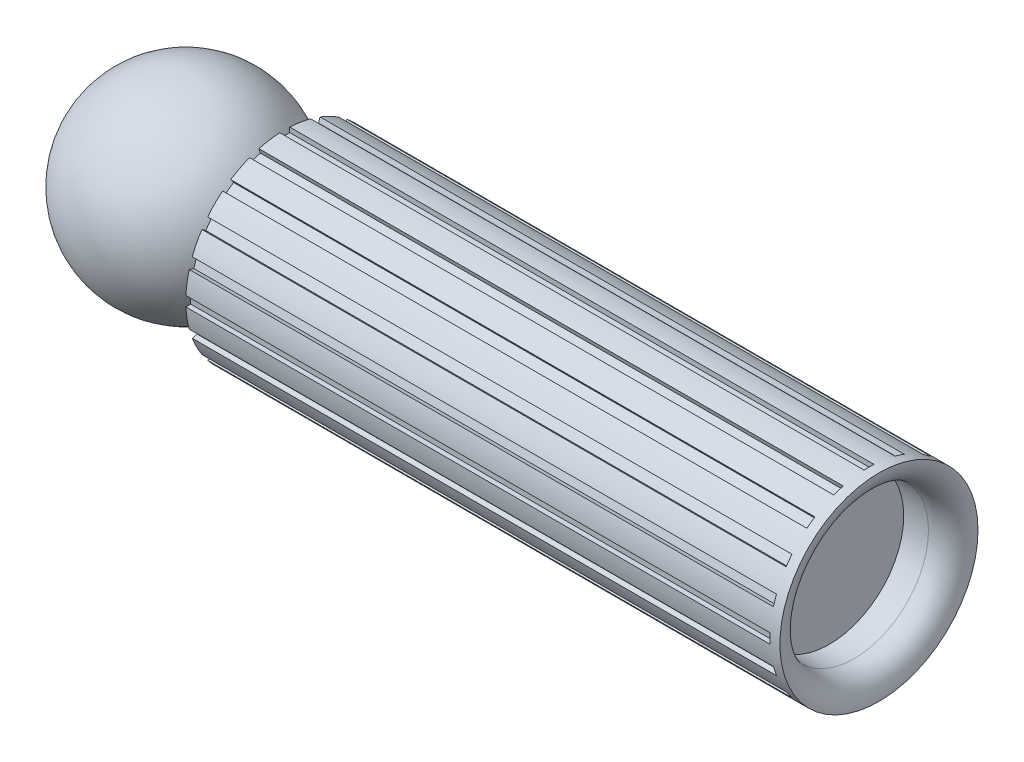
ISO-10303-21;
HEADER;
FILE_DESCRIPTION(('STEP AP214'),'2;1');
FILE_NAME('part.step','',(''),(''),'','','');
FILE_SCHEMA(('AUTOMOTIVE_DESIGN { 1 0 10303 214 1 1 1 1 }'));
ENDSEC;
DATA;
#1=APPLICATION_CONTEXT('core data for automotive mechanical design processes');
#2=APPLICATION_PROTOCOL_DEFINITION('international standard','automotive_design',2000,#1);
#3=PRODUCT_CONTEXT('',#1,'mechanical');
#4=PRODUCT('Part','Part','',(#3));
#5=PRODUCT_RELATED_PRODUCT_CATEGORY('part','',(#4));
#6=PRODUCT_DEFINITION_FORMATION('','',#4);
#7=PRODUCT_DEFINITION_CONTEXT('part definition',#1,'design');
#8=PRODUCT_DEFINITION('design','',#6,#7);
#9=PRODUCT_DEFINITION_SHAPE('','',#8);
#10=(LENGTH_UNIT() NAMED_UNIT(*) SI_UNIT(.MILLI.,.METRE.));
#11=(NAMED_UNIT(*) PLANE_ANGLE_UNIT() SI_UNIT($,.RADIAN.));
#12=(NAMED_UNIT(*) SI_UNIT($,.STERADIAN.) SOLID_ANGLE_UNIT());
#13=UNCERTAINTY_MEASURE_WITH_UNIT(LENGTH_MEASURE(1.E-05),#10,'distance_accuracy_value','');
#14=(GEOMETRIC_REPRESENTATION_CONTEXT(3) GLOBAL_UNCERTAINTY_ASSIGNED_CONTEXT((#13)) GLOBAL_UNIT_ASSIGNED_CONTEXT((#10,
#11,#12)) REPRESENTATION_CONTEXT('',''));
#15=CARTESIAN_POINT('',(0.,0.,0.));
#16=DIRECTION('',(0.,0.,1.));
#17=DIRECTION('',(1.,0.,0.));
#18=AXIS2_PLACEMENT_3D('',#15,#16,#17);
#19=CARTESIAN_POINT('',(-50.,-100.,0.));
#20=DIRECTION('',(0.,1.,0.));
#21=DIRECTION('',(1.,0.,0.));
#22=AXIS2_PLACEMENT_3D('',#19,#20,#21);
#23=SPHERICAL_SURFACE('',#22,20.);
#24=CARTESIAN_POINT('',(-50.,-80.,0.));
#25=VERTEX_POINT('',#24);
#26=VERTEX_LOOP('',#25);
#27=FACE_BOUND('',#26,.T.);
#28=ADVANCED_FACE('F116',(#27),#23,.T.);
#29=CLOSED_SHELL('',(#28));
#30=MANIFOLD_SOLID_BREP('B2',#29);
#31=CARTESIAN_POINT('',(-70.001,-35.1369355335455,-48.3618428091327));
#32=DIRECTION('',(0.,0.587785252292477,0.809016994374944));
#33=DIRECTION('',(0.,-0.809016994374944,0.587785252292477));
#34=AXIS2_PLACEMENT_3D('',#31,#32,#33);
#35=PLANE('',#34);
#36=DIRECTION('',(1.,0.,0.));
#37=VECTOR('',#36,1.);
#38=CARTESIAN_POINT('',(-70.001,-85.2191543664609,-11.9749809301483));
#39=LINE('',#38,#37);
#40=CARTESIAN_POINT('',(-30.,-85.2191543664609,-11.9749809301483));
#41=VERTEX_POINT('',#40);
#42=CARTESIAN_POINT('',(88.,-85.2191543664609,-11.9749809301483));
#43=VERTEX_POINT('',#42);
#44=EDGE_CURVE('E903',#41,#43,#39,.T.);
#45=ORIENTED_EDGE('',*,*,#44,.T.);
#46=DIRECTION('',(0.,0.809016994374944,-0.587785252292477));
#47=VECTOR('',#46,1.);
#48=CARTESIAN_POINT('',(88.,-35.1369355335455,-48.3618428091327));
#49=LINE('',#48,#47);
#50=CARTESIAN_POINT('',(88.,-84.4276834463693,-12.5500182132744));
#51=VERTEX_POINT('',#50);
#52=EDGE_CURVE('E145',#43,#51,#49,.T.);
#53=ORIENTED_EDGE('',*,*,#52,.T.);
#54=DIRECTION('',(1.,0.,0.));
#55=VECTOR('',#54,1.);
#56=CARTESIAN_POINT('',(-30.,-84.4276834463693,-12.5500182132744));
#57=LINE('',#56,#55);
#58=CARTESIAN_POINT('',(-30.,-84.4276834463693,-12.5500182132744));
#59=VERTEX_POINT('',#58);
#60=EDGE_CURVE('E913',#59,#51,#57,.T.);
#61=ORIENTED_EDGE('',*,*,#60,.F.);
#62=DIRECTION('',(0.,0.809016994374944,-0.587785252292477));
#63=VECTOR('',#62,1.);
#64=CARTESIAN_POINT('',(-30.,-35.1369355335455,-48.3618428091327));
#65=LINE('',#64,#63);
#66=EDGE_CURVE('E902',#41,#59,#65,.T.);
#67=ORIENTED_EDGE('',*,*,#66,.F.);
#68=EDGE_LOOP('',(#45,#53,#61,#67));
#69=FACE_BOUND('',#68,.T.);
#70=ADVANCED_FACE('F130',(#69),#35,.T.);
#71=CARTESIAN_POINT('',(-70.001,-33.9613650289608,-46.7438088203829));
#72=DIRECTION('',(0.,0.587785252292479,0.809016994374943));
#73=DIRECTION('',(0.,-0.809016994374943,0.587785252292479));
#74=AXIS2_PLACEMENT_3D('',#71,#72,#73);
#75=PLANE('',#74);
#76=DIRECTION('',(0.,0.809016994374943,-0.587785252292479));
#77=VECTOR('',#76,1.);
#78=CARTESIAN_POINT('',(88.,-33.9613650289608,-46.7438088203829));
#79=LINE('',#78,#77);
#80=CARTESIAN_POINT('',(88.,-84.0435838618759,-10.3569469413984));
#81=VERTEX_POINT('',#80);
#82=CARTESIAN_POINT('',(88.,-83.2521129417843,-10.9319842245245));
#83=VERTEX_POINT('',#82);
#84=EDGE_CURVE('E1126',#81,#83,#79,.T.);
#85=ORIENTED_EDGE('',*,*,#84,.F.);
#86=DIRECTION('',(1.,0.,0.));
#87=VECTOR('',#86,1.);
#88=CARTESIAN_POINT('',(-70.001,-84.0435838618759,-10.3569469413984));
#89=LINE('',#88,#87);
#90=CARTESIAN_POINT('',(-30.,-84.0435838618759,-10.3569469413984));
#91=VERTEX_POINT('',#90);
#92=EDGE_CURVE('E908',#91,#81,#89,.T.);
#93=ORIENTED_EDGE('',*,*,#92,.F.);
#94=DIRECTION('',(0.,0.809016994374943,-0.587785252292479));
#95=VECTOR('',#94,1.);
#96=CARTESIAN_POINT('',(-30.,-33.9613650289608,-46.7438088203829));
#97=LINE('',#96,#95);
#98=CARTESIAN_POINT('',(-30.,-83.2521129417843,-10.9319842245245));
#99=VERTEX_POINT('',#98);
#100=EDGE_CURVE('E900',#91,#99,#97,.T.);
#101=ORIENTED_EDGE('',*,*,#100,.T.);
#102=DIRECTION('',(1.,0.,0.));
#103=VECTOR('',#102,1.);
#104=CARTESIAN_POINT('',(-30.,-83.2521129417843,-10.9319842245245));
#105=LINE('',#104,#103);
#106=EDGE_CURVE('E153',#99,#83,#105,.T.);
#107=ORIENTED_EDGE('',*,*,#106,.T.);
#108=EDGE_LOOP('',(#85,#93,#101,#107));
#109=FACE_BOUND('',#108,.T.);
#110=ADVANCED_FACE('F1282',(#109),#75,.F.);
#111=CARTESIAN_POINT('',(-70.001,-84.0435838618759,-10.3569469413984));
#112=DIRECTION('',(0.,-0.809016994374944,0.587785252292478));
#113=DIRECTION('',(0.,-0.587785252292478,-0.809016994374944));
#114=AXIS2_PLACEMENT_3D('',#111,#112,#113);
#115=PLANE('',#114);
#116=DIRECTION('',(0.,0.587785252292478,0.809016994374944));
#117=VECTOR('',#116,1.);
#118=CARTESIAN_POINT('',(88.,-84.0435838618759,-10.3569469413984));
#119=LINE('',#118,#117);
#120=EDGE_CURVE('E1128',#43,#81,#119,.T.);
#121=ORIENTED_EDGE('',*,*,#120,.F.);
#122=ORIENTED_EDGE('',*,*,#44,.F.);
#123=DIRECTION('',(0.,0.587785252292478,0.809016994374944));
#124=VECTOR('',#123,1.);
#125=CARTESIAN_POINT('',(-30.,-84.0435838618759,-10.3569469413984));
#126=LINE('',#125,#124);
#127=EDGE_CURVE('E800',#41,#91,#126,.T.);
#128=ORIENTED_EDGE('',*,*,#127,.T.);
#129=ORIENTED_EDGE('',*,*,#92,.T.);
#130=EDGE_LOOP('',(#121,#122,#128,#129));
#131=FACE_BOUND('',#130,.T.);
#132=ADVANCED_FACE('F1287',(#131),#115,.F.);
#133=CARTESIAN_POINT('',(-70.001,-88.0250190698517,-14.7808456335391));
#134=DIRECTION('',(0.,-0.587785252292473,0.809016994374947));
#135=DIRECTION('',(0.,-0.809016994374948,-0.587785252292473));
#136=AXIS2_PLACEMENT_3D('',#133,#134,#135);
#137=PLANE('',#136);
#138=DIRECTION('',(0.,0.809016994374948,0.587785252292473));
#139=VECTOR('',#138,1.);
#140=CARTESIAN_POINT('',(88.,-88.0250190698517,-14.7808456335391));
#141=LINE('',#140,#139);
#142=CARTESIAN_POINT('',(88.,-89.6430530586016,-15.9564161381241));
#143=VERTEX_POINT('',#142);
#144=CARTESIAN_POINT('',(88.,-88.0250190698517,-14.7808456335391));
#145=VERTEX_POINT('',#144);
#146=EDGE_CURVE('E1133',#143,#145,#141,.T.);
#147=ORIENTED_EDGE('',*,*,#146,.F.);
#148=DIRECTION('',(1.,0.,0.));
#149=VECTOR('',#148,1.);
#150=CARTESIAN_POINT('',(-70.001,-89.6430530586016,-15.9564161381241));
#151=LINE('',#150,#149);
#152=CARTESIAN_POINT('',(-30.,-89.6430530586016,-15.9564161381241));
#153=VERTEX_POINT('',#152);
#154=EDGE_CURVE('E689',#153,#143,#151,.T.);
#155=ORIENTED_EDGE('',*,*,#154,.F.);
#156=DIRECTION('',(0.,0.809016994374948,0.587785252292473));
#157=VECTOR('',#156,1.);
#158=CARTESIAN_POINT('',(-30.,-88.0250190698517,-14.7808456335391));
#159=LINE('',#158,#157);
#160=CARTESIAN_POINT('',(-30.,-88.0250190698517,-14.7808456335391));
#161=VERTEX_POINT('',#160);
#162=EDGE_CURVE('E687',#153,#161,#159,.T.);
#163=ORIENTED_EDGE('',*,*,#162,.T.);
#164=DIRECTION('',(1.,0.,0.));
#165=VECTOR('',#164,1.);
#166=CARTESIAN_POINT('',(-70.001,-88.0250190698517,-14.7808456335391));
#167=LINE('',#166,#165);
#168=EDGE_CURVE('E691',#161,#145,#167,.T.);
#169=ORIENTED_EDGE('',*,*,#168,.T.);
#170=EDGE_LOOP('',(#147,#155,#163,#169));
#171=FACE_BOUND('',#170,.T.);
#172=ADVANCED_FACE('F1293',(#171),#137,.F.);
#173=CARTESIAN_POINT('',(-70.001,-87.4333221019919,-15.5952466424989));
#174=DIRECTION('',(0.,0.809016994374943,0.587785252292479));
#175=DIRECTION('',(0.,-0.587785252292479,0.809016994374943));
#176=AXIS2_PLACEMENT_3D('',#173,#174,#175);
#177=PLANE('',#176);
#178=DIRECTION('',(0.,0.587785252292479,-0.809016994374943));
#179=VECTOR('',#178,1.);
#180=CARTESIAN_POINT('',(88.,-87.4333221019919,-15.5952466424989));
#181=LINE('',#180,#179);
#182=CARTESIAN_POINT('',(88.,-87.4499817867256,-15.5723165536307));
#183=VERTEX_POINT('',#182);
#184=EDGE_CURVE('E1131',#145,#183,#181,.T.);
#185=ORIENTED_EDGE('',*,*,#184,.F.);
#186=ORIENTED_EDGE('',*,*,#168,.F.);
#187=DIRECTION('',(0.,0.587785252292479,-0.809016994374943));
#188=VECTOR('',#187,1.);
#189=CARTESIAN_POINT('',(-30.,-87.4333221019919,-15.5952466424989));
#190=LINE('',#189,#188);
#191=CARTESIAN_POINT('',(-30.,-87.4499817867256,-15.5723165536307));
#192=VERTEX_POINT('',#191);
#193=EDGE_CURVE('E694',#161,#192,#190,.T.);
#194=ORIENTED_EDGE('',*,*,#193,.T.);
#195=DIRECTION('',(1.,0.,0.));
#196=VECTOR('',#195,1.);
#197=CARTESIAN_POINT('',(-30.,-87.4499817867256,-15.5723165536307));
#198=LINE('',#197,#196);
#199=EDGE_CURVE('E702',#183,#192,#198,.F.);
#200=ORIENTED_EDGE('',*,*,#199,.F.);
#201=EDGE_LOOP('',(#185,#186,#194,#200));
#202=FACE_BOUND('',#201,.T.);
#203=ADVANCED_FACE('F1616',(#202),#177,.F.);
#204=CARTESIAN_POINT('',(-70.001,-89.0513560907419,-16.7708171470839));
#205=DIRECTION('',(0.,0.80901699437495,0.58778525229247));
#206=DIRECTION('',(0.,-0.58778525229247,0.80901699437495));
#207=AXIS2_PLACEMENT_3D('',#204,#205,#206);
#208=PLANE('',#207);
#209=ORIENTED_EDGE('',*,*,#154,.T.);
#210=DIRECTION('',(0.,0.58778525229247,-0.80901699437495));
#211=VECTOR('',#210,1.);
#212=CARTESIAN_POINT('',(88.,-89.0513560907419,-16.7708171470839));
#213=LINE('',#212,#211);
#214=CARTESIAN_POINT('',(88.,-89.0680157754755,-16.7478870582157));
#215=VERTEX_POINT('',#214);
#216=EDGE_CURVE('E1135',#143,#215,#213,.T.);
#217=ORIENTED_EDGE('',*,*,#216,.T.);
#218=DIRECTION('',(1.,0.,0.));
#219=VECTOR('',#218,1.);
#220=CARTESIAN_POINT('',(-30.,-89.0680157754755,-16.7478870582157));
#221=LINE('',#220,#219);
#222=CARTESIAN_POINT('',(-30.,-89.0680157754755,-16.7478870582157));
#223=VERTEX_POINT('',#222);
#224=EDGE_CURVE('E670',#215,#223,#221,.F.);
#225=ORIENTED_EDGE('',*,*,#224,.T.);
#226=DIRECTION('',(0.,0.58778525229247,-0.80901699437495));
#227=VECTOR('',#226,1.);
#228=CARTESIAN_POINT('',(-30.,-89.0513560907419,-16.7708171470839));
#229=LINE('',#228,#227);
#230=EDGE_CURVE('E699',#153,#223,#229,.T.);
#231=ORIENTED_EDGE('',*,*,#230,.F.);
#232=EDGE_LOOP('',(#209,#217,#225,#231));
#233=FACE_BOUND('',#232,.T.);
#234=ADVANCED_FACE('F1611',(#233),#208,.T.);
#235=CARTESIAN_POINT('',(-70.001,-93.1786488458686,-17.7578921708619));
#236=DIRECTION('',(0.,-0.309016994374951,0.951056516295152));
#237=DIRECTION('',(0.,-0.951056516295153,-0.309016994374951));
#238=AXIS2_PLACEMENT_3D('',#235,#236,#237);
#239=PLANE('',#238);
#240=DIRECTION('',(0.,0.951056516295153,0.309016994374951));
#241=VECTOR('',#240,1.);
#242=CARTESIAN_POINT('',(88.,-93.1786488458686,-17.7578921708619));
#243=LINE('',#242,#241);
#244=CARTESIAN_POINT('',(88.,-95.0807618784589,-18.3759261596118));
#245=VERTEX_POINT('',#244);
#246=CARTESIAN_POINT('',(88.,-93.1786488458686,-17.7578921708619));
#247=VERTEX_POINT('',#246);
#248=EDGE_CURVE('E1140',#245,#247,#243,.T.);
#249=ORIENTED_EDGE('',*,*,#248,.F.);
#250=DIRECTION('',(1.,0.,0.));
#251=VECTOR('',#250,1.);
#252=CARTESIAN_POINT('',(-70.001,-95.0807618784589,-18.3759261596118));
#253=LINE('',#252,#251);
#254=CARTESIAN_POINT('',(-30.,-95.0807618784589,-18.3759261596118));
#255=VERTEX_POINT('',#254);
#256=EDGE_CURVE('E669',#255,#245,#253,.T.);
#257=ORIENTED_EDGE('',*,*,#256,.F.);
#258=DIRECTION('',(0.,0.951056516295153,0.309016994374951));
#259=VECTOR('',#258,1.);
#260=CARTESIAN_POINT('',(-30.,-93.1786488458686,-17.7578921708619));
#261=LINE('',#260,#259);
#262=CARTESIAN_POINT('',(-30.,-93.1786488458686,-17.7578921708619));
#263=VERTEX_POINT('',#262);
#264=EDGE_CURVE('E679',#255,#263,#261,.T.);
#265=ORIENTED_EDGE('',*,*,#264,.T.);
#266=DIRECTION('',(1.,0.,0.));
#267=VECTOR('',#266,1.);
#268=CARTESIAN_POINT('',(-70.001,-93.1786488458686,-17.7578921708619));
#269=LINE('',#268,#267);
#270=EDGE_CURVE('E673',#263,#247,#269,.T.);
#271=ORIENTED_EDGE('',*,*,#270,.T.);
#272=EDGE_LOOP('',(#249,#257,#265,#271));
#273=FACE_BOUND('',#272,.T.);
#274=ADVANCED_FACE('F1607',(#273),#239,.F.);
#275=CARTESIAN_POINT('',(-70.001,-94.7696883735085,-19.3333119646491));
#276=DIRECTION('',(0.,0.951056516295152,0.309016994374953));
#277=DIRECTION('',(0.,-0.309016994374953,0.951056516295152));
#278=AXIS2_PLACEMENT_3D('',#275,#276,#277);
#279=PLANE('',#278);
#280=ORIENTED_EDGE('',*,*,#256,.T.);
#281=DIRECTION('',(0.,0.309016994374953,-0.951056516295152));
#282=VECTOR('',#281,1.);
#283=CARTESIAN_POINT('',(88.,-94.7696883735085,-19.3333119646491));
#284=LINE('',#283,#282);
#285=CARTESIAN_POINT('',(88.,-94.7784468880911,-19.3063560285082));
#286=VERTEX_POINT('',#285);
#287=EDGE_CURVE('E1138',#245,#286,#284,.T.);
#288=ORIENTED_EDGE('',*,*,#287,.T.);
#289=DIRECTION('',(1.,0.,0.));
#290=VECTOR('',#289,1.);
#291=CARTESIAN_POINT('',(-30.,-94.7784468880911,-19.3063560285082));
#292=LINE('',#291,#290);
#293=CARTESIAN_POINT('',(-30.,-94.7784468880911,-19.3063560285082));
#294=VERTEX_POINT('',#293);
#295=EDGE_CURVE('E682',#286,#294,#292,.F.);
#296=ORIENTED_EDGE('',*,*,#295,.T.);
#297=DIRECTION('',(0.,0.309016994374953,-0.951056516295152));
#298=VECTOR('',#297,1.);
#299=CARTESIAN_POINT('',(-30.,-94.7696883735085,-19.3333119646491));
#300=LINE('',#299,#298);
#301=EDGE_CURVE('E676',#255,#294,#300,.T.);
#302=ORIENTED_EDGE('',*,*,#301,.F.);
#303=EDGE_LOOP('',(#280,#288,#296,#302));
#304=FACE_BOUND('',#303,.T.);
#305=ADVANCED_FACE('F1604',(#304),#279,.T.);
#306=CARTESIAN_POINT('',(-70.001,-92.8675753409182,-18.7152779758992));
#307=DIRECTION('',(0.,0.951056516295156,0.309016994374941));
#308=DIRECTION('',(0.,-0.309016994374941,0.951056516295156));
#309=AXIS2_PLACEMENT_3D('',#306,#307,#308);
#310=PLANE('',#309);
#311=DIRECTION('',(0.,0.309016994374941,-0.951056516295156));
#312=VECTOR('',#311,1.);
#313=CARTESIAN_POINT('',(88.,-92.8675753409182,-18.7152779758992));
#314=LINE('',#313,#312);
#315=CARTESIAN_POINT('',(88.,-92.8763338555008,-18.6883220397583));
#316=VERTEX_POINT('',#315);
#317=EDGE_CURVE('E638',#247,#316,#314,.T.);
#318=ORIENTED_EDGE('',*,*,#317,.F.);
#319=ORIENTED_EDGE('',*,*,#270,.F.);
#320=DIRECTION('',(0.,0.309016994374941,-0.951056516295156));
#321=VECTOR('',#320,1.);
#322=CARTESIAN_POINT('',(-30.,-92.8675753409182,-18.7152779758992));
#323=LINE('',#322,#321);
#324=CARTESIAN_POINT('',(-30.,-92.8763338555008,-18.6883220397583));
#325=VERTEX_POINT('',#324);
#326=EDGE_CURVE('E666',#263,#325,#323,.T.);
#327=ORIENTED_EDGE('',*,*,#326,.T.);
#328=DIRECTION('',(1.,0.,0.));
#329=VECTOR('',#328,1.);
#330=CARTESIAN_POINT('',(-30.,-92.8763338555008,-18.6883220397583));
#331=LINE('',#330,#329);
#332=EDGE_CURVE('E684',#316,#325,#331,.F.);
#333=ORIENTED_EDGE('',*,*,#332,.F.);
#334=EDGE_LOOP('',(#318,#319,#327,#333));
#335=FACE_BOUND('',#334,.T.);
#336=ADVANCED_FACE('F1601',(#335),#310,.F.);
#337=CARTESIAN_POINT('',(-70.001,-99.,-18.9966724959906));
#338=DIRECTION('',(0.,0.,1.));
#339=DIRECTION('',(1.,0.,0.));
#340=AXIS2_PLACEMENT_3D('',#337,#338,#339);
#341=PLANE('',#340);
#342=DIRECTION('',(0.,1.,0.));
#343=VECTOR('',#342,1.);
#344=CARTESIAN_POINT('',(88.,-99.,-18.9966724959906));
#345=LINE('',#344,#343);
#346=CARTESIAN_POINT('',(88.,-101.,-18.9966724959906));
#347=VERTEX_POINT('',#346);
#348=CARTESIAN_POINT('',(88.,-99.,-18.9966724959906));
#349=VERTEX_POINT('',#348);
#350=EDGE_CURVE('E633',#347,#349,#345,.T.);
#351=ORIENTED_EDGE('',*,*,#350,.F.);
#352=DIRECTION('',(1.,0.,0.));
#353=VECTOR('',#352,1.);
#354=CARTESIAN_POINT('',(-70.001,-101.,-18.9966724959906));
#355=LINE('',#354,#353);
#356=CARTESIAN_POINT('',(-30.,-101.,-18.9966724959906));
#357=VERTEX_POINT('',#356);
#358=EDGE_CURVE('E1027',#357,#347,#355,.T.);
#359=ORIENTED_EDGE('',*,*,#358,.F.);
#360=DIRECTION('',(0.,1.,0.));
#361=VECTOR('',#360,1.);
#362=CARTESIAN_POINT('',(-30.,-99.,-18.9966724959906));
#363=LINE('',#362,#361);
#364=CARTESIAN_POINT('',(-30.,-99.,-18.9966724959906));
#365=VERTEX_POINT('',#364);
#366=EDGE_CURVE('E686',#357,#365,#363,.T.);
#367=ORIENTED_EDGE('',*,*,#366,.T.);
#368=DIRECTION('',(1.,0.,0.));
#369=VECTOR('',#368,1.);
#370=CARTESIAN_POINT('',(-70.001,-99.,-18.9966724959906));
#371=LINE('',#370,#369);
#372=EDGE_CURVE('E1030',#365,#349,#371,.T.);
#373=ORIENTED_EDGE('',*,*,#372,.T.);
#374=EDGE_LOOP('',(#351,#359,#367,#373));
#375=FACE_BOUND('',#374,.T.);
#376=ADVANCED_FACE('F1029',(#375),#341,.F.);
#377=CARTESIAN_POINT('',(-70.001,-99.,-20.0033275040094));
#378=DIRECTION('',(0.,1.,0.));
#379=DIRECTION('',(0.,0.,1.));
#380=AXIS2_PLACEMENT_3D('',#377,#378,#379);
#381=PLANE('',#380);
#382=DIRECTION('',(0.,0.,-1.));
#383=VECTOR('',#382,1.);
#384=CARTESIAN_POINT('',(88.,-99.,-20.0033275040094));
#385=LINE('',#384,#383);
#386=CARTESIAN_POINT('',(88.,-99.,-19.9749843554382));
#387=VERTEX_POINT('',#386);
#388=EDGE_CURVE('E627',#349,#387,#385,.T.);
#389=ORIENTED_EDGE('',*,*,#388,.F.);
#390=ORIENTED_EDGE('',*,*,#372,.F.);
#391=DIRECTION('',(0.,0.,-1.));
#392=VECTOR('',#391,1.);
#393=CARTESIAN_POINT('',(-30.,-99.,-20.0033275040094));
#394=LINE('',#393,#392);
#395=CARTESIAN_POINT('',(-30.,-99.,-19.9749843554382));
#396=VERTEX_POINT('',#395);
#397=EDGE_CURVE('E656',#365,#396,#394,.T.);
#398=ORIENTED_EDGE('',*,*,#397,.T.);
#399=DIRECTION('',(1.,0.,0.));
#400=VECTOR('',#399,1.);
#401=CARTESIAN_POINT('',(-30.,-99.,-19.9749843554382));
#402=LINE('',#401,#400);
#403=EDGE_CURVE('E646',#387,#396,#402,.F.);
#404=ORIENTED_EDGE('',*,*,#403,.F.);
#405=EDGE_LOOP('',(#389,#390,#398,#404));
#406=FACE_BOUND('',#405,.T.);
#407=ADVANCED_FACE('F654',(#406),#381,.F.);
#408=CARTESIAN_POINT('',(-70.001,-101.,-20.0033275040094));
#409=DIRECTION('',(0.,1.,0.));
#410=DIRECTION('',(0.,0.,1.));
#411=AXIS2_PLACEMENT_3D('',#408,#409,#410);
#412=PLANE('',#411);
#413=ORIENTED_EDGE('',*,*,#358,.T.);
#414=DIRECTION('',(0.,0.,-1.));
#415=VECTOR('',#414,1.);
#416=CARTESIAN_POINT('',(88.,-101.,-20.0033275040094));
#417=LINE('',#416,#415);
#418=CARTESIAN_POINT('',(88.,-101.,-19.9749843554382));
#419=VERTEX_POINT('',#418);
#420=EDGE_CURVE('E1146',#347,#419,#417,.T.);
#421=ORIENTED_EDGE('',*,*,#420,.T.);
#422=DIRECTION('',(1.,0.,0.));
#423=VECTOR('',#422,1.);
#424=CARTESIAN_POINT('',(-30.,-101.,-19.9749843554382));
#425=LINE('',#424,#423);
#426=CARTESIAN_POINT('',(-30.,-101.,-19.9749843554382));
#427=VERTEX_POINT('',#426);
#428=EDGE_CURVE('E649',#419,#427,#425,.F.);
#429=ORIENTED_EDGE('',*,*,#428,.T.);
#430=DIRECTION('',(0.,0.,-1.));
#431=VECTOR('',#430,1.);
#432=CARTESIAN_POINT('',(-30.,-101.,-20.0033275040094));
#433=LINE('',#432,#431);
#434=EDGE_CURVE('E658',#357,#427,#433,.T.);
#435=ORIENTED_EDGE('',*,*,#434,.F.);
#436=EDGE_LOOP('',(#413,#421,#429,#435));
#437=FACE_BOUND('',#436,.T.);
#438=ADVANCED_FACE('F1026',(#437),#412,.T.);
#439=CARTESIAN_POINT('',(-70.001,-110.356946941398,-15.956416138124));
#440=DIRECTION('',(0.,0.587785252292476,0.809016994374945));
#441=DIRECTION('',(0.,-0.809016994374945,0.587785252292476));
#442=AXIS2_PLACEMENT_3D('',#439,#440,#441);
#443=PLANE('',#442);
#444=DIRECTION('',(0.,0.809016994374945,-0.587785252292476));
#445=VECTOR('',#444,1.);
#446=CARTESIAN_POINT('',(88.,-110.356946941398,-15.956416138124));
#447=LINE('',#446,#445);
#448=CARTESIAN_POINT('',(88.,-111.974980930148,-14.7808456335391));
#449=VERTEX_POINT('',#448);
#450=CARTESIAN_POINT('',(88.,-110.356946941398,-15.956416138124));
#451=VERTEX_POINT('',#450);
#452=EDGE_CURVE('E1150',#449,#451,#447,.T.);
#453=ORIENTED_EDGE('',*,*,#452,.F.);
#454=DIRECTION('',(1.,0.,0.));
#455=VECTOR('',#454,1.);
#456=CARTESIAN_POINT('',(-70.001,-111.974980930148,-14.7808456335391));
#457=LINE('',#456,#455);
#458=CARTESIAN_POINT('',(-30.,-111.974980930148,-14.7808456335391));
#459=VERTEX_POINT('',#458);
#460=EDGE_CURVE('E1047',#459,#449,#457,.T.);
#461=ORIENTED_EDGE('',*,*,#460,.F.);
#462=DIRECTION('',(0.,0.809016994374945,-0.587785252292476));
#463=VECTOR('',#462,1.);
#464=CARTESIAN_POINT('',(-30.,-110.356946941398,-15.956416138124));
#465=LINE('',#464,#463);
#466=CARTESIAN_POINT('',(-30.,-110.356946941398,-15.956416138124));
#467=VERTEX_POINT('',#466);
#468=EDGE_CURVE('E660',#459,#467,#465,.T.);
#469=ORIENTED_EDGE('',*,*,#468,.T.);
#470=DIRECTION('',(1.,0.,0.));
#471=VECTOR('',#470,1.);
#472=CARTESIAN_POINT('',(-70.001,-110.356946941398,-15.956416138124));
#473=LINE('',#472,#471);
#474=EDGE_CURVE('E1046',#467,#451,#473,.T.);
#475=ORIENTED_EDGE('',*,*,#474,.T.);
#476=EDGE_LOOP('',(#453,#461,#469,#475));
#477=FACE_BOUND('',#476,.T.);
#478=ADVANCED_FACE('F1579',(#477),#443,.F.);
#479=CARTESIAN_POINT('',(-70.001,-110.948643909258,-16.7708171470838));
#480=DIRECTION('',(0.,0.809016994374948,-0.587785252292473));
#481=DIRECTION('',(0.,0.587785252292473,0.809016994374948));
#482=AXIS2_PLACEMENT_3D('',#479,#480,#481);
#483=PLANE('',#482);
#484=DIRECTION('',(0.,-0.587785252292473,-0.809016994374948));
#485=VECTOR('',#484,1.);
#486=CARTESIAN_POINT('',(88.,-110.948643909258,-16.7708171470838));
#487=LINE('',#486,#485);
#488=CARTESIAN_POINT('',(88.,-110.931984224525,-16.7478870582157));
#489=VERTEX_POINT('',#488);
#490=EDGE_CURVE('E1148',#451,#489,#487,.T.);
#491=ORIENTED_EDGE('',*,*,#490,.F.);
#492=ORIENTED_EDGE('',*,*,#474,.F.);
#493=DIRECTION('',(0.,-0.587785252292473,-0.809016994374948));
#494=VECTOR('',#493,1.);
#495=CARTESIAN_POINT('',(-30.,-110.948643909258,-16.7708171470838));
#496=LINE('',#495,#494);
#497=CARTESIAN_POINT('',(-30.,-110.931984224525,-16.7478870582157));
#498=VERTEX_POINT('',#497);
#499=EDGE_CURVE('E1043',#467,#498,#496,.T.);
#500=ORIENTED_EDGE('',*,*,#499,.T.);
#501=DIRECTION('',(1.,0.,0.));
#502=VECTOR('',#501,1.);
#503=CARTESIAN_POINT('',(-30.,-110.931984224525,-16.7478870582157));
#504=LINE('',#503,#502);
#505=EDGE_CURVE('E1038',#489,#498,#504,.F.);
#506=ORIENTED_EDGE('',*,*,#505,.F.);
#507=EDGE_LOOP('',(#491,#492,#500,#506));
#508=FACE_BOUND('',#507,.T.);
#509=ADVANCED_FACE('F1585',(#508),#483,.F.);
#510=CARTESIAN_POINT('',(-70.001,-112.566677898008,-15.5952466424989));
#511=DIRECTION('',(0.,0.809016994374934,-0.587785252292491));
#512=DIRECTION('',(0.,0.587785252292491,0.809016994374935));
#513=AXIS2_PLACEMENT_3D('',#510,#511,#512);
#514=PLANE('',#513);
#515=ORIENTED_EDGE('',*,*,#460,.T.);
#516=DIRECTION('',(0.,-0.587785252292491,-0.809016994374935));
#517=VECTOR('',#516,1.);
#518=CARTESIAN_POINT('',(88.,-112.566677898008,-15.5952466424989));
#519=LINE('',#518,#517);
#520=CARTESIAN_POINT('',(88.,-112.550018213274,-15.5723165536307));
#521=VERTEX_POINT('',#520);
#522=EDGE_CURVE('E1152',#449,#521,#519,.T.);
#523=ORIENTED_EDGE('',*,*,#522,.T.);
#524=DIRECTION('',(1.,0.,0.));
#525=VECTOR('',#524,1.);
#526=CARTESIAN_POINT('',(-30.,-112.550018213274,-15.5723165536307));
#527=LINE('',#526,#525);
#528=CARTESIAN_POINT('',(-30.,-112.550018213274,-15.5723165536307));
#529=VERTEX_POINT('',#528);
#530=EDGE_CURVE('E1035',#521,#529,#527,.F.);
#531=ORIENTED_EDGE('',*,*,#530,.T.);
#532=DIRECTION('',(0.,-0.587785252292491,-0.809016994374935));
#533=VECTOR('',#532,1.);
#534=CARTESIAN_POINT('',(-30.,-112.566677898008,-15.5952466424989));
#535=LINE('',#534,#533);
#536=EDGE_CURVE('E1040',#459,#529,#535,.T.);
#537=ORIENTED_EDGE('',*,*,#536,.F.);
#538=EDGE_LOOP('',(#515,#523,#531,#537));
#539=FACE_BOUND('',#538,.T.);
#540=ADVANCED_FACE('F1576',(#539),#514,.T.);
#541=CARTESIAN_POINT('',(-70.001,-114.780845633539,-11.9749809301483));
#542=DIRECTION('',(0.,0.809016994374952,0.587785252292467));
#543=DIRECTION('',(0.,-0.587785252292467,0.809016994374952));
#544=AXIS2_PLACEMENT_3D('',#541,#542,#543);
#545=PLANE('',#544);
#546=DIRECTION('',(0.,0.587785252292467,-0.809016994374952));
#547=VECTOR('',#546,1.);
#548=CARTESIAN_POINT('',(88.,-114.780845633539,-11.9749809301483));
#549=LINE('',#548,#547);
#550=CARTESIAN_POINT('',(88.,-115.956416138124,-10.3569469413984));
#551=VERTEX_POINT('',#550);
#552=CARTESIAN_POINT('',(88.,-114.780845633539,-11.9749809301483));
#553=VERTEX_POINT('',#552);
#554=EDGE_CURVE('E1157',#551,#553,#549,.T.);
#555=ORIENTED_EDGE('',*,*,#554,.F.);
#556=DIRECTION('',(1.,0.,0.));
#557=VECTOR('',#556,1.);
#558=CARTESIAN_POINT('',(-70.001,-115.956416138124,-10.3569469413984));
#559=LINE('',#558,#557);
#560=CARTESIAN_POINT('',(-30.,-115.956416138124,-10.3569469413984));
#561=VERTEX_POINT('',#560);
#562=EDGE_CURVE('E1067',#561,#551,#559,.T.);
#563=ORIENTED_EDGE('',*,*,#562,.F.);
#564=DIRECTION('',(0.,0.587785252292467,-0.809016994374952));
#565=VECTOR('',#564,1.);
#566=CARTESIAN_POINT('',(-30.,-114.780845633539,-11.9749809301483));
#567=LINE('',#566,#565);
#568=CARTESIAN_POINT('',(-30.,-114.780845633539,-11.9749809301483));
#569=VERTEX_POINT('',#568);
#570=EDGE_CURVE('E1058',#561,#569,#567,.T.);
#571=ORIENTED_EDGE('',*,*,#570,.T.);
#572=DIRECTION('',(1.,0.,0.));
#573=VECTOR('',#572,1.);
#574=CARTESIAN_POINT('',(-70.001,-114.780845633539,-11.9749809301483));
#575=LINE('',#574,#573);
#576=EDGE_CURVE('E1064',#569,#553,#575,.T.);
#577=ORIENTED_EDGE('',*,*,#576,.T.);
#578=EDGE_LOOP('',(#555,#563,#571,#577));
#579=FACE_BOUND('',#578,.T.);
#580=ADVANCED_FACE('F1572',(#579),#545,.F.);
#581=CARTESIAN_POINT('',(-70.001,-116.770817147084,-10.9486439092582));
#582=DIRECTION('',(0.,0.587785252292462,-0.809016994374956));
#583=DIRECTION('',(0.,0.809016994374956,0.587785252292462));
#584=AXIS2_PLACEMENT_3D('',#581,#582,#583);
#585=PLANE('',#584);
#586=ORIENTED_EDGE('',*,*,#562,.T.);
#587=DIRECTION('',(0.,-0.809016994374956,-0.587785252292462));
#588=VECTOR('',#587,1.);
#589=CARTESIAN_POINT('',(88.,-116.770817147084,-10.9486439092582));
#590=LINE('',#589,#588);
#591=CARTESIAN_POINT('',(88.,-116.747887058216,-10.9319842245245));
#592=VERTEX_POINT('',#591);
#593=EDGE_CURVE('E1155',#551,#592,#590,.T.);
#594=ORIENTED_EDGE('',*,*,#593,.T.);
#595=DIRECTION('',(1.,0.,0.));
#596=VECTOR('',#595,1.);
#597=CARTESIAN_POINT('',(-30.,-116.747887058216,-10.9319842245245));
#598=LINE('',#597,#596);
#599=CARTESIAN_POINT('',(-30.,-116.747887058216,-10.9319842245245));
#600=VERTEX_POINT('',#599);
#601=EDGE_CURVE('E1056',#592,#600,#598,.F.);
#602=ORIENTED_EDGE('',*,*,#601,.T.);
#603=DIRECTION('',(0.,-0.809016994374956,-0.587785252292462));
#604=VECTOR('',#603,1.);
#605=CARTESIAN_POINT('',(-30.,-116.770817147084,-10.9486439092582));
#606=LINE('',#605,#604);
#607=EDGE_CURVE('E1061',#561,#600,#606,.T.);
#608=ORIENTED_EDGE('',*,*,#607,.F.);
#609=EDGE_LOOP('',(#586,#594,#602,#608));
#610=FACE_BOUND('',#609,.T.);
#611=ADVANCED_FACE('F1565',(#610),#585,.T.);
#612=CARTESIAN_POINT('',(-70.001,-115.595246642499,-12.5666778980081));
#613=DIRECTION('',(0.,0.587785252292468,-0.809016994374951));
#614=DIRECTION('',(0.,0.809016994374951,0.587785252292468));
#615=AXIS2_PLACEMENT_3D('',#612,#613,#614);
#616=PLANE('',#615);
#617=DIRECTION('',(0.,-0.809016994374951,-0.587785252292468));
#618=VECTOR('',#617,1.);
#619=CARTESIAN_POINT('',(88.,-115.595246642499,-12.5666778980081));
#620=LINE('',#619,#618);
#621=CARTESIAN_POINT('',(88.,-115.572316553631,-12.5500182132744));
#622=VERTEX_POINT('',#621);
#623=EDGE_CURVE('E1160',#553,#622,#620,.T.);
#624=ORIENTED_EDGE('',*,*,#623,.F.);
#625=ORIENTED_EDGE('',*,*,#576,.F.);
#626=DIRECTION('',(0.,-0.809016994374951,-0.587785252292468));
#627=VECTOR('',#626,1.);
#628=CARTESIAN_POINT('',(-30.,-115.595246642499,-12.5666778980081));
#629=LINE('',#628,#627);
#630=CARTESIAN_POINT('',(-30.,-115.572316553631,-12.5500182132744));
#631=VERTEX_POINT('',#630);
#632=EDGE_CURVE('E1037',#569,#631,#629,.T.);
#633=ORIENTED_EDGE('',*,*,#632,.T.);
#634=DIRECTION('',(1.,0.,0.));
#635=VECTOR('',#634,1.);
#636=CARTESIAN_POINT('',(-30.,-115.572316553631,-12.5500182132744));
#637=LINE('',#636,#635);
#638=EDGE_CURVE('E1053',#622,#631,#637,.F.);
#639=ORIENTED_EDGE('',*,*,#638,.F.);
#640=EDGE_LOOP('',(#624,#625,#633,#639));
#641=FACE_BOUND('',#640,.T.);
#642=ADVANCED_FACE('F1570',(#641),#616,.F.);
#643=CARTESIAN_POINT('',(-70.001,-117.757892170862,-6.82135115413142));
#644=DIRECTION('',(0.,0.951056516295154,0.309016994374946));
#645=DIRECTION('',(0.,-0.309016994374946,0.951056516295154));
#646=AXIS2_PLACEMENT_3D('',#643,#644,#645);
#647=PLANE('',#646);
#648=DIRECTION('',(0.,0.309016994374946,-0.951056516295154));
#649=VECTOR('',#648,1.);
#650=CARTESIAN_POINT('',(88.,-117.757892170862,-6.82135115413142));
#651=LINE('',#650,#649);
#652=CARTESIAN_POINT('',(88.,-118.375926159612,-4.91923812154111));
#653=VERTEX_POINT('',#652);
#654=CARTESIAN_POINT('',(88.,-117.757892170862,-6.82135115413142));
#655=VERTEX_POINT('',#654);
#656=EDGE_CURVE('E1165',#653,#655,#651,.T.);
#657=ORIENTED_EDGE('',*,*,#656,.F.);
#658=DIRECTION('',(1.,0.,0.));
#659=VECTOR('',#658,1.);
#660=CARTESIAN_POINT('',(-70.001,-118.375926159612,-4.91923812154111));
#661=LINE('',#660,#659);
#662=CARTESIAN_POINT('',(-30.,-118.375926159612,-4.91923812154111));
#663=VERTEX_POINT('',#662);
#664=EDGE_CURVE('E1084',#663,#653,#661,.T.);
#665=ORIENTED_EDGE('',*,*,#664,.F.);
#666=DIRECTION('',(0.,0.309016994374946,-0.951056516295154));
#667=VECTOR('',#666,1.);
#668=CARTESIAN_POINT('',(-30.,-117.757892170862,-6.82135115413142));
#669=LINE('',#668,#667);
#670=CARTESIAN_POINT('',(-30.,-117.757892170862,-6.82135115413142));
#671=VERTEX_POINT('',#670);
#672=EDGE_CURVE('E1055',#663,#671,#669,.T.);
#673=ORIENTED_EDGE('',*,*,#672,.T.);
#674=DIRECTION('',(1.,0.,0.));
#675=VECTOR('',#674,1.);
#676=CARTESIAN_POINT('',(-70.001,-117.757892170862,-6.82135115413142));
#677=LINE('',#676,#675);
#678=EDGE_CURVE('E1083',#671,#655,#677,.T.);
#679=ORIENTED_EDGE('',*,*,#678,.T.);
#680=EDGE_LOOP('',(#657,#665,#673,#679));
#681=FACE_BOUND('',#680,.T.);
#682=ADVANCED_FACE('F1554',(#681),#647,.F.);
#683=CARTESIAN_POINT('',(-70.001,-118.715277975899,-7.13242465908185));
#684=DIRECTION('',(0.,0.309016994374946,-0.951056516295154));
#685=DIRECTION('',(0.,0.951056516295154,0.309016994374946));
#686=AXIS2_PLACEMENT_3D('',#683,#684,#685);
#687=PLANE('',#686);
#688=DIRECTION('',(0.,-0.951056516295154,-0.309016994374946));
#689=VECTOR('',#688,1.);
#690=CARTESIAN_POINT('',(88.,-118.715277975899,-7.13242465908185));
#691=LINE('',#690,#689);
#692=CARTESIAN_POINT('',(88.,-118.688322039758,-7.12366614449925));
#693=VERTEX_POINT('',#692);
#694=EDGE_CURVE('E1163',#655,#693,#691,.T.);
#695=ORIENTED_EDGE('',*,*,#694,.F.);
#696=ORIENTED_EDGE('',*,*,#678,.F.);
#697=DIRECTION('',(0.,-0.951056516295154,-0.309016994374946));
#698=VECTOR('',#697,1.);
#699=CARTESIAN_POINT('',(-30.,-118.715277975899,-7.13242465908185));
#700=LINE('',#699,#698);
#701=CARTESIAN_POINT('',(-30.,-118.688322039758,-7.12366614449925));
#702=VERTEX_POINT('',#701);
#703=EDGE_CURVE('E1080',#671,#702,#700,.T.);
#704=ORIENTED_EDGE('',*,*,#703,.T.);
#705=DIRECTION('',(1.,0.,0.));
#706=VECTOR('',#705,1.);
#707=CARTESIAN_POINT('',(-30.,-118.688322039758,-7.12366614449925));
#708=LINE('',#707,#706);
#709=EDGE_CURVE('E1075',#693,#702,#708,.F.);
#710=ORIENTED_EDGE('',*,*,#709,.F.);
#711=EDGE_LOOP('',(#695,#696,#704,#710));
#712=FACE_BOUND('',#711,.T.);
#713=ADVANCED_FACE('F1560',(#712),#687,.F.);
#714=CARTESIAN_POINT('',(-70.001,-119.333311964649,-5.23031162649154));
#715=DIRECTION('',(0.,0.309016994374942,-0.951056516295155));
#716=DIRECTION('',(0.,0.951056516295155,0.309016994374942));
#717=AXIS2_PLACEMENT_3D('',#714,#715,#716);
#718=PLANE('',#717);
#719=ORIENTED_EDGE('',*,*,#664,.T.);
#720=DIRECTION('',(0.,-0.951056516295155,-0.309016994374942));
#721=VECTOR('',#720,1.);
#722=CARTESIAN_POINT('',(88.,-119.333311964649,-5.23031162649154));
#723=LINE('',#722,#721);
#724=CARTESIAN_POINT('',(88.,-119.306356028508,-5.22155311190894));
#725=VERTEX_POINT('',#724);
#726=EDGE_CURVE('E1167',#653,#725,#723,.T.);
#727=ORIENTED_EDGE('',*,*,#726,.T.);
#728=DIRECTION('',(1.,0.,0.));
#729=VECTOR('',#728,1.);
#730=CARTESIAN_POINT('',(-30.,-119.306356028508,-5.22155311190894));
#731=LINE('',#730,#729);
#732=CARTESIAN_POINT('',(-30.,-119.306356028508,-5.22155311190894));
#733=VERTEX_POINT('',#732);
#734=EDGE_CURVE('E1072',#725,#733,#731,.F.);
#735=ORIENTED_EDGE('',*,*,#734,.T.);
#736=DIRECTION('',(0.,-0.951056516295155,-0.309016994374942));
#737=VECTOR('',#736,1.);
#738=CARTESIAN_POINT('',(-30.,-119.333311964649,-5.23031162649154));
#739=LINE('',#738,#737);
#740=EDGE_CURVE('E1077',#663,#733,#739,.T.);
#741=ORIENTED_EDGE('',*,*,#740,.F.);
#742=EDGE_LOOP('',(#719,#727,#735,#741));
#743=FACE_BOUND('',#742,.T.);
#744=ADVANCED_FACE('F1551',(#743),#718,.T.);
#745=CARTESIAN_POINT('',(-70.001,-118.375926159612,4.9192381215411));
#746=DIRECTION('',(0.,0.951056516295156,-0.30901699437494));
#747=DIRECTION('',(0.,0.30901699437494,0.951056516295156));
#748=AXIS2_PLACEMENT_3D('',#745,#746,#747);
#749=PLANE('',#748);
#750=DIRECTION('',(0.,-0.30901699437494,-0.951056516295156));
#751=VECTOR('',#750,1.);
#752=CARTESIAN_POINT('',(88.,-118.375926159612,4.9192381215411));
#753=LINE('',#752,#751);
#754=CARTESIAN_POINT('',(88.,-117.757892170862,6.8213511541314));
#755=VERTEX_POINT('',#754);
#756=CARTESIAN_POINT('',(88.,-118.375926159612,4.9192381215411));
#757=VERTEX_POINT('',#756);
#758=EDGE_CURVE('E1172',#755,#757,#753,.T.);
#759=ORIENTED_EDGE('',*,*,#758,.F.);
#760=DIRECTION('',(1.,0.,0.));
#761=VECTOR('',#760,1.);
#762=CARTESIAN_POINT('',(-70.001,-117.757892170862,6.82135115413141));
#763=LINE('',#762,#761);
#764=CARTESIAN_POINT('',(-30.,-117.757892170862,6.82135115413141));
#765=VERTEX_POINT('',#764);
#766=EDGE_CURVE('E1102',#765,#755,#763,.T.);
#767=ORIENTED_EDGE('',*,*,#766,.F.);
#768=DIRECTION('',(0.,-0.30901699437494,-0.951056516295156));
#769=VECTOR('',#768,1.);
#770=CARTESIAN_POINT('',(-30.,-118.375926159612,4.9192381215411));
#771=LINE('',#770,#769);
#772=CARTESIAN_POINT('',(-30.,-118.375926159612,4.9192381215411));
#773=VERTEX_POINT('',#772);
#774=EDGE_CURVE('E1074',#765,#773,#771,.T.);
#775=ORIENTED_EDGE('',*,*,#774,.T.);
#776=DIRECTION('',(1.,0.,0.));
#777=VECTOR('',#776,1.);
#778=CARTESIAN_POINT('',(-70.001,-118.375926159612,4.9192381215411));
#779=LINE('',#778,#777);
#780=EDGE_CURVE('E1101',#773,#757,#779,.T.);
#781=ORIENTED_EDGE('',*,*,#780,.T.);
#782=EDGE_LOOP('',(#759,#767,#775,#781));
#783=FACE_BOUND('',#782,.T.);
#784=ADVANCED_FACE('F1534',(#783),#749,.F.);
#785=CARTESIAN_POINT('',(-70.001,-119.333311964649,5.23031162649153));
#786=DIRECTION('',(0.,-0.30901699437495,-0.951056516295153));
#787=DIRECTION('',(0.,0.951056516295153,-0.30901699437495));
#788=AXIS2_PLACEMENT_3D('',#785,#786,#787);
#789=PLANE('',#788);
#790=DIRECTION('',(0.,-0.951056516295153,0.30901699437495));
#791=VECTOR('',#790,1.);
#792=CARTESIAN_POINT('',(88.,-119.333311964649,5.23031162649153));
#793=LINE('',#792,#791);
#794=CARTESIAN_POINT('',(88.,-119.306356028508,5.22155311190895));
#795=VERTEX_POINT('',#794);
#796=EDGE_CURVE('E1170',#757,#795,#793,.T.);
#797=ORIENTED_EDGE('',*,*,#796,.F.);
#798=ORIENTED_EDGE('',*,*,#780,.F.);
#799=DIRECTION('',(0.,-0.951056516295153,0.30901699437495));
#800=VECTOR('',#799,1.);
#801=CARTESIAN_POINT('',(-30.,-119.333311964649,5.23031162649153));
#802=LINE('',#801,#800);
#803=CARTESIAN_POINT('',(-30.,-119.306356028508,5.22155311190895));
#804=VERTEX_POINT('',#803);
#805=EDGE_CURVE('E1098',#773,#804,#802,.T.);
#806=ORIENTED_EDGE('',*,*,#805,.T.);
#807=DIRECTION('',(1.,0.,0.));
#808=VECTOR('',#807,1.);
#809=CARTESIAN_POINT('',(-30.,-119.306356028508,5.22155311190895));
#810=LINE('',#809,#808);
#811=EDGE_CURVE('E1093',#795,#804,#810,.F.);
#812=ORIENTED_EDGE('',*,*,#811,.F.);
#813=EDGE_LOOP('',(#797,#798,#806,#812));
#814=FACE_BOUND('',#813,.T.);
#815=ADVANCED_FACE('F1540',(#814),#789,.F.);
#816=CARTESIAN_POINT('',(-70.001,-118.715277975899,7.13242465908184));
#817=DIRECTION('',(0.,-0.309016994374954,-0.951056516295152));
#818=DIRECTION('',(0.,0.951056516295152,-0.309016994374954));
#819=AXIS2_PLACEMENT_3D('',#816,#817,#818);
#820=PLANE('',#819);
#821=ORIENTED_EDGE('',*,*,#766,.T.);
#822=DIRECTION('',(0.,-0.951056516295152,0.309016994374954));
#823=VECTOR('',#822,1.);
#824=CARTESIAN_POINT('',(88.,-118.715277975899,7.13242465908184));
#825=LINE('',#824,#823);
#826=CARTESIAN_POINT('',(88.,-118.688322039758,7.12366614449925));
#827=VERTEX_POINT('',#826);
#828=EDGE_CURVE('E1174',#755,#827,#825,.T.);
#829=ORIENTED_EDGE('',*,*,#828,.T.);
#830=DIRECTION('',(1.,0.,0.));
#831=VECTOR('',#830,1.);
#832=CARTESIAN_POINT('',(-30.,-118.688322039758,7.12366614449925));
#833=LINE('',#832,#831);
#834=CARTESIAN_POINT('',(-30.,-118.688322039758,7.12366614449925));
#835=VERTEX_POINT('',#834);
#836=EDGE_CURVE('E1090',#827,#835,#833,.F.);
#837=ORIENTED_EDGE('',*,*,#836,.T.);
#838=DIRECTION('',(0.,-0.951056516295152,0.309016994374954));
#839=VECTOR('',#838,1.);
#840=CARTESIAN_POINT('',(-30.,-118.715277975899,7.13242465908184));
#841=LINE('',#840,#839);
#842=EDGE_CURVE('E1095',#765,#835,#841,.T.);
#843=ORIENTED_EDGE('',*,*,#842,.F.);
#844=EDGE_LOOP('',(#821,#829,#837,#843));
#845=FACE_BOUND('',#844,.T.);
#846=ADVANCED_FACE('F1531',(#845),#820,.T.);
#847=CARTESIAN_POINT('',(-70.001,-115.956416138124,10.3569469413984));
#848=DIRECTION('',(0.,0.809016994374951,-0.587785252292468));
#849=DIRECTION('',(0.,0.587785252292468,0.809016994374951));
#850=AXIS2_PLACEMENT_3D('',#847,#848,#849);
#851=PLANE('',#850);
#852=DIRECTION('',(0.,-0.587785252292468,-0.809016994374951));
#853=VECTOR('',#852,1.);
#854=CARTESIAN_POINT('',(88.,-115.956416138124,10.3569469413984));
#855=LINE('',#854,#853);
#856=CARTESIAN_POINT('',(88.,-114.780845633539,11.9749809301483));
#857=VERTEX_POINT('',#856);
#858=CARTESIAN_POINT('',(88.,-115.956416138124,10.3569469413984));
#859=VERTEX_POINT('',#858);
#860=EDGE_CURVE('E1179',#857,#859,#855,.T.);
#861=ORIENTED_EDGE('',*,*,#860,.F.);
#862=DIRECTION('',(1.,0.,0.));
#863=VECTOR('',#862,1.);
#864=CARTESIAN_POINT('',(-70.001,-114.780845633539,11.9749809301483));
#865=LINE('',#864,#863);
#866=CARTESIAN_POINT('',(-30.,-114.780845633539,11.9749809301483));
#867=VERTEX_POINT('',#866);
#868=EDGE_CURVE('E1120',#867,#857,#865,.T.);
#869=ORIENTED_EDGE('',*,*,#868,.F.);
#870=DIRECTION('',(0.,-0.587785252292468,-0.809016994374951));
#871=VECTOR('',#870,1.);
#872=CARTESIAN_POINT('',(-30.,-115.956416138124,10.3569469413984));
#873=LINE('',#872,#871);
#874=CARTESIAN_POINT('',(-30.,-115.956416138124,10.3569469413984));
#875=VERTEX_POINT('',#874);
#876=EDGE_CURVE('E1111',#867,#875,#873,.T.);
#877=ORIENTED_EDGE('',*,*,#876,.T.);
#878=DIRECTION('',(1.,0.,0.));
#879=VECTOR('',#878,1.);
#880=CARTESIAN_POINT('',(-70.001,-115.956416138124,10.3569469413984));
#881=LINE('',#880,#879);
#882=EDGE_CURVE('E1117',#875,#859,#881,.T.);
#883=ORIENTED_EDGE('',*,*,#882,.T.);
#884=EDGE_LOOP('',(#861,#869,#877,#883));
#885=FACE_BOUND('',#884,.T.);
#886=ADVANCED_FACE('F1526',(#885),#851,.F.);
#887=CARTESIAN_POINT('',(-70.001,-115.595246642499,12.5666778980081));
#888=DIRECTION('',(0.,-0.587785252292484,-0.80901699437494));
#889=DIRECTION('',(0.,0.80901699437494,-0.587785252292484));
#890=AXIS2_PLACEMENT_3D('',#887,#888,#889);
#891=PLANE('',#890);
#892=ORIENTED_EDGE('',*,*,#868,.T.);
#893=DIRECTION('',(0.,-0.80901699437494,0.587785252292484));
#894=VECTOR('',#893,1.);
#895=CARTESIAN_POINT('',(88.,-115.595246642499,12.5666778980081));
#896=LINE('',#895,#894);
#897=CARTESIAN_POINT('',(88.,-115.572316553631,12.5500182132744));
#898=VERTEX_POINT('',#897);
#899=EDGE_CURVE('E1177',#857,#898,#896,.T.);
#900=ORIENTED_EDGE('',*,*,#899,.T.);
#901=DIRECTION('',(1.,0.,0.));
#902=VECTOR('',#901,1.);
#903=CARTESIAN_POINT('',(-30.,-115.572316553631,12.5500182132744));
#904=LINE('',#903,#902);
#905=CARTESIAN_POINT('',(-30.,-115.572316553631,12.5500182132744));
#906=VERTEX_POINT('',#905);
#907=EDGE_CURVE('E1109',#898,#906,#904,.F.);
#908=ORIENTED_EDGE('',*,*,#907,.T.);
#909=DIRECTION('',(0.,-0.80901699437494,0.587785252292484));
#910=VECTOR('',#909,1.);
#911=CARTESIAN_POINT('',(-30.,-115.595246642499,12.5666778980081));
#912=LINE('',#911,#910);
#913=EDGE_CURVE('E1114',#867,#906,#912,.T.);
#914=ORIENTED_EDGE('',*,*,#913,.F.);
#915=EDGE_LOOP('',(#892,#900,#908,#914));
#916=FACE_BOUND('',#915,.T.);
#917=ADVANCED_FACE('F1520',(#916),#891,.T.);
#918=CARTESIAN_POINT('',(-70.001,-116.770817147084,10.9486439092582));
#919=DIRECTION('',(0.,-0.587785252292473,-0.809016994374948));
#920=DIRECTION('',(0.,0.809016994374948,-0.587785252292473));
#921=AXIS2_PLACEMENT_3D('',#918,#919,#920);
#922=PLANE('',#921);
#923=DIRECTION('',(0.,-0.809016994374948,0.587785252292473));
#924=VECTOR('',#923,1.);
#925=CARTESIAN_POINT('',(88.,-116.770817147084,10.9486439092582));
#926=LINE('',#925,#924);
#927=CARTESIAN_POINT('',(88.,-116.747887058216,10.9319842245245));
#928=VERTEX_POINT('',#927);
#929=EDGE_CURVE('E1182',#859,#928,#926,.T.);
#930=ORIENTED_EDGE('',*,*,#929,.F.);
#931=ORIENTED_EDGE('',*,*,#882,.F.);
#932=DIRECTION('',(0.,-0.809016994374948,0.587785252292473));
#933=VECTOR('',#932,1.);
#934=CARTESIAN_POINT('',(-30.,-116.770817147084,10.9486439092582));
#935=LINE('',#934,#933);
#936=CARTESIAN_POINT('',(-30.,-116.747887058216,10.9319842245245));
#937=VERTEX_POINT('',#936);
#938=EDGE_CURVE('E1092',#875,#937,#935,.T.);
#939=ORIENTED_EDGE('',*,*,#938,.T.);
#940=DIRECTION('',(1.,0.,0.));
#941=VECTOR('',#940,1.);
#942=CARTESIAN_POINT('',(-30.,-116.747887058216,10.9319842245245));
#943=LINE('',#942,#941);
#944=EDGE_CURVE('E765',#928,#937,#943,.F.);
#945=ORIENTED_EDGE('',*,*,#944,.F.);
#946=EDGE_LOOP('',(#930,#931,#939,#945));
#947=FACE_BOUND('',#946,.T.);
#948=ADVANCED_FACE('F1399',(#947),#922,.F.);
#949=CARTESIAN_POINT('',(-70.001,-104.919238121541,-18.3759261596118));
#950=DIRECTION('',(0.,0.309016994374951,0.951056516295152));
#951=DIRECTION('',(0.,-0.951056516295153,0.309016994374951));
#952=AXIS2_PLACEMENT_3D('',#949,#950,#951);
#953=PLANE('',#952);
#954=DIRECTION('',(0.,0.951056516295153,-0.309016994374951));
#955=VECTOR('',#954,1.);
#956=CARTESIAN_POINT('',(88.,-104.919238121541,-18.3759261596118));
#957=LINE('',#956,#955);
#958=CARTESIAN_POINT('',(88.,-106.821351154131,-17.7578921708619));
#959=VERTEX_POINT('',#958);
#960=CARTESIAN_POINT('',(88.,-104.919238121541,-18.3759261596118));
#961=VERTEX_POINT('',#960);
#962=EDGE_CURVE('E1187',#959,#961,#957,.T.);
#963=ORIENTED_EDGE('',*,*,#962,.F.);
#964=DIRECTION('',(1.,0.,0.));
#965=VECTOR('',#964,1.);
#966=CARTESIAN_POINT('',(-70.001,-106.821351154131,-17.7578921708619));
#967=LINE('',#966,#965);
#968=CARTESIAN_POINT('',(-30.,-106.821351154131,-17.7578921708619));
#969=VERTEX_POINT('',#968);
#970=EDGE_CURVE('E783',#969,#959,#967,.T.);
#971=ORIENTED_EDGE('',*,*,#970,.F.);
#972=DIRECTION('',(0.,0.951056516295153,-0.309016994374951));
#973=VECTOR('',#972,1.);
#974=CARTESIAN_POINT('',(-30.,-104.919238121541,-18.3759261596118));
#975=LINE('',#974,#973);
#976=CARTESIAN_POINT('',(-30.,-104.919238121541,-18.3759261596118));
#977=VERTEX_POINT('',#976);
#978=EDGE_CURVE('E793',#969,#977,#975,.T.);
#979=ORIENTED_EDGE('',*,*,#978,.T.);
#980=DIRECTION('',(1.,0.,0.));
#981=VECTOR('',#980,1.);
#982=CARTESIAN_POINT('',(-70.001,-104.919238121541,-18.3759261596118));
#983=LINE('',#982,#981);
#984=EDGE_CURVE('E787',#977,#961,#983,.T.);
#985=ORIENTED_EDGE('',*,*,#984,.T.);
#986=EDGE_LOOP('',(#963,#971,#979,#985));
#987=FACE_BOUND('',#986,.T.);
#988=ADVANCED_FACE('F1386',(#987),#953,.F.);
#989=CARTESIAN_POINT('',(-70.001,-107.132424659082,-18.7152779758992));
#990=DIRECTION('',(0.,0.951056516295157,-0.309016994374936));
#991=DIRECTION('',(0.,0.309016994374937,0.951056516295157));
#992=AXIS2_PLACEMENT_3D('',#989,#990,#991);
#993=PLANE('',#992);
#994=ORIENTED_EDGE('',*,*,#970,.T.);
#995=DIRECTION('',(0.,-0.309016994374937,-0.951056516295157));
#996=VECTOR('',#995,1.);
#997=CARTESIAN_POINT('',(88.,-107.132424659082,-18.7152779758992));
#998=LINE('',#997,#996);
#999=CARTESIAN_POINT('',(88.,-107.123666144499,-18.6883220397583));
#1000=VERTEX_POINT('',#999);
#1001=EDGE_CURVE('E1185',#959,#1000,#998,.T.);
#1002=ORIENTED_EDGE('',*,*,#1001,.T.);
#1003=DIRECTION('',(1.,0.,0.));
#1004=VECTOR('',#1003,1.);
#1005=CARTESIAN_POINT('',(-30.,-107.123666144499,-18.6883220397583));
#1006=LINE('',#1005,#1004);
#1007=CARTESIAN_POINT('',(-30.,-107.123666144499,-18.6883220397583));
#1008=VERTEX_POINT('',#1007);
#1009=EDGE_CURVE('E796',#1000,#1008,#1006,.F.);
#1010=ORIENTED_EDGE('',*,*,#1009,.T.);
#1011=DIRECTION('',(0.,-0.309016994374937,-0.951056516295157));
#1012=VECTOR('',#1011,1.);
#1013=CARTESIAN_POINT('',(-30.,-107.132424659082,-18.7152779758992));
#1014=LINE('',#1013,#1012);
#1015=EDGE_CURVE('E790',#969,#1008,#1014,.T.);
#1016=ORIENTED_EDGE('',*,*,#1015,.F.);
#1017=EDGE_LOOP('',(#994,#1002,#1010,#1016));
#1018=FACE_BOUND('',#1017,.T.);
#1019=ADVANCED_FACE('F1390',(#1018),#993,.T.);
#1020=CARTESIAN_POINT('',(-70.001,-105.230311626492,-19.3333119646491));
#1021=DIRECTION('',(0.,0.951056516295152,-0.309016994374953));
#1022=DIRECTION('',(0.,0.309016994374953,0.951056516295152));
#1023=AXIS2_PLACEMENT_3D('',#1020,#1021,#1022);
#1024=PLANE('',#1023);
#1025=DIRECTION('',(0.,-0.309016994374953,-0.951056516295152));
#1026=VECTOR('',#1025,1.);
#1027=CARTESIAN_POINT('',(88.,-105.230311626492,-19.3333119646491));
#1028=LINE('',#1027,#1026);
#1029=CARTESIAN_POINT('',(88.,-105.221553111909,-19.3063560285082));
#1030=VERTEX_POINT('',#1029);
#1031=EDGE_CURVE('E1190',#961,#1030,#1028,.T.);
#1032=ORIENTED_EDGE('',*,*,#1031,.F.);
#1033=ORIENTED_EDGE('',*,*,#984,.F.);
#1034=DIRECTION('',(0.,-0.309016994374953,-0.951056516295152));
#1035=VECTOR('',#1034,1.);
#1036=CARTESIAN_POINT('',(-30.,-105.230311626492,-19.3333119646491));
#1037=LINE('',#1036,#1035);
#1038=CARTESIAN_POINT('',(-30.,-105.221553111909,-19.3063560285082));
#1039=VERTEX_POINT('',#1038);
#1040=EDGE_CURVE('E780',#977,#1039,#1037,.T.);
#1041=ORIENTED_EDGE('',*,*,#1040,.T.);
#1042=DIRECTION('',(1.,0.,0.));
#1043=VECTOR('',#1042,1.);
#1044=CARTESIAN_POINT('',(-30.,-105.221553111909,-19.3063560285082));
#1045=LINE('',#1044,#1043);
#1046=EDGE_CURVE('E798',#1030,#1039,#1045,.F.);
#1047=ORIENTED_EDGE('',*,*,#1046,.F.);
#1048=EDGE_LOOP('',(#1032,#1033,#1041,#1047));
#1049=FACE_BOUND('',#1048,.T.);
#1050=ADVANCED_FACE('F1384',(#1049),#1024,.F.);
#1051=CARTESIAN_POINT('',(-70.001,-118.996672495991,-1.));
#1052=DIRECTION('',(0.,1.,0.));
#1053=DIRECTION('',(0.,0.,1.));
#1054=AXIS2_PLACEMENT_3D('',#1051,#1052,#1053);
#1055=PLANE('',#1054);
#1056=DIRECTION('',(0.,0.,-1.));
#1057=VECTOR('',#1056,1.);
#1058=CARTESIAN_POINT('',(88.,-118.996672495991,-1.));
#1059=LINE('',#1058,#1057);
#1060=CARTESIAN_POINT('',(88.,-118.996672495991,0.999999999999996));
#1061=VERTEX_POINT('',#1060);
#1062=CARTESIAN_POINT('',(88.,-118.996672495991,-1.));
#1063=VERTEX_POINT('',#1062);
#1064=EDGE_CURVE('E1195',#1061,#1063,#1059,.T.);
#1065=ORIENTED_EDGE('',*,*,#1064,.F.);
#1066=DIRECTION('',(1.,0.,0.));
#1067=VECTOR('',#1066,1.);
#1068=CARTESIAN_POINT('',(-70.001,-118.996672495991,0.999999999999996));
#1069=LINE('',#1068,#1067);
#1070=CARTESIAN_POINT('',(-30.,-118.996672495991,0.999999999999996));
#1071=VERTEX_POINT('',#1070);
#1072=EDGE_CURVE('E804',#1071,#1061,#1069,.T.);
#1073=ORIENTED_EDGE('',*,*,#1072,.F.);
#1074=DIRECTION('',(0.,0.,-1.));
#1075=VECTOR('',#1074,1.);
#1076=CARTESIAN_POINT('',(-30.,-118.996672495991,-1.));
#1077=LINE('',#1076,#1075);
#1078=CARTESIAN_POINT('',(-30.,-118.996672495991,-1.));
#1079=VERTEX_POINT('',#1078);
#1080=EDGE_CURVE('E814',#1071,#1079,#1077,.T.);
#1081=ORIENTED_EDGE('',*,*,#1080,.T.);
#1082=DIRECTION('',(1.,0.,0.));
#1083=VECTOR('',#1082,1.);
#1084=CARTESIAN_POINT('',(-70.001,-118.996672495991,-1.));
#1085=LINE('',#1084,#1083);
#1086=EDGE_CURVE('E808',#1079,#1063,#1085,.T.);
#1087=ORIENTED_EDGE('',*,*,#1086,.T.);
#1088=EDGE_LOOP('',(#1065,#1073,#1081,#1087));
#1089=FACE_BOUND('',#1088,.T.);
#1090=ADVANCED_FACE('F1397',(#1089),#1055,.F.);
#1091=CARTESIAN_POINT('',(-70.001,-120.003327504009,0.999999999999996));
#1092=DIRECTION('',(0.,0.,-1.));
#1093=DIRECTION('',(0.,1.,0.));
#1094=AXIS2_PLACEMENT_3D('',#1091,#1092,#1093);
#1095=PLANE('',#1094);
#1096=ORIENTED_EDGE('',*,*,#1072,.T.);
#1097=DIRECTION('',(0.,-1.,0.));
#1098=VECTOR('',#1097,1.);
#1099=CARTESIAN_POINT('',(88.,-120.003327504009,0.999999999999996));
#1100=LINE('',#1099,#1098);
#1101=CARTESIAN_POINT('',(88.,-119.974984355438,0.999999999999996));
#1102=VERTEX_POINT('',#1101);
#1103=EDGE_CURVE('E1193',#1061,#1102,#1100,.T.);
#1104=ORIENTED_EDGE('',*,*,#1103,.T.);
#1105=DIRECTION('',(1.,0.,0.));
#1106=VECTOR('',#1105,1.);
#1107=CARTESIAN_POINT('',(-30.,-119.974984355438,0.999999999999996));
#1108=LINE('',#1107,#1106);
#1109=CARTESIAN_POINT('',(-30.,-119.974984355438,0.999999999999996));
#1110=VERTEX_POINT('',#1109);
#1111=EDGE_CURVE('E817',#1102,#1110,#1108,.F.);
#1112=ORIENTED_EDGE('',*,*,#1111,.T.);
#1113=DIRECTION('',(0.,-1.,0.));
#1114=VECTOR('',#1113,1.);
#1115=CARTESIAN_POINT('',(-30.,-120.003327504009,0.999999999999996));
#1116=LINE('',#1115,#1114);
#1117=EDGE_CURVE('E811',#1071,#1110,#1116,.T.);
#1118=ORIENTED_EDGE('',*,*,#1117,.F.);
#1119=EDGE_LOOP('',(#1096,#1104,#1112,#1118));
#1120=FACE_BOUND('',#1119,.T.);
#1121=ADVANCED_FACE('F1405',(#1120),#1095,.T.);
#1122=CARTESIAN_POINT('',(-70.001,-120.003327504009,-1.));
#1123=DIRECTION('',(0.,0.,-1.));
#1124=DIRECTION('',(0.,1.,0.));
#1125=AXIS2_PLACEMENT_3D('',#1122,#1123,#1124);
#1126=PLANE('',#1125);
#1127=DIRECTION('',(0.,-1.,0.));
#1128=VECTOR('',#1127,1.);
#1129=CARTESIAN_POINT('',(88.,-120.003327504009,-1.));
#1130=LINE('',#1129,#1128);
#1131=CARTESIAN_POINT('',(88.,-119.974984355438,-1.));
#1132=VERTEX_POINT('',#1131);
#1133=EDGE_CURVE('E1198',#1063,#1132,#1130,.T.);
#1134=ORIENTED_EDGE('',*,*,#1133,.F.);
#1135=ORIENTED_EDGE('',*,*,#1086,.F.);
#1136=DIRECTION('',(0.,-1.,0.));
#1137=VECTOR('',#1136,1.);
#1138=CARTESIAN_POINT('',(-30.,-120.003327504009,-1.));
#1139=LINE('',#1138,#1137);
#1140=CARTESIAN_POINT('',(-30.,-119.974984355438,-1.));
#1141=VERTEX_POINT('',#1140);
#1142=EDGE_CURVE('E801',#1079,#1141,#1139,.T.);
#1143=ORIENTED_EDGE('',*,*,#1142,.T.);
#1144=DIRECTION('',(1.,0.,0.));
#1145=VECTOR('',#1144,1.);
#1146=CARTESIAN_POINT('',(-30.,-119.974984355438,-1.));
#1147=LINE('',#1146,#1145);
#1148=EDGE_CURVE('E784',#1132,#1141,#1147,.F.);
#1149=ORIENTED_EDGE('',*,*,#1148,.F.);
#1150=EDGE_LOOP('',(#1134,#1135,#1143,#1149));
#1151=FACE_BOUND('',#1150,.T.);
#1152=ADVANCED_FACE('F1408',(#1151),#1126,.F.);
#1153=CARTESIAN_POINT('',(-70.001,-106.821351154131,17.7578921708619));
#1154=DIRECTION('',(0.,0.309016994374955,-0.951056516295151));
#1155=DIRECTION('',(0.,0.951056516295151,0.309016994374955));
#1156=AXIS2_PLACEMENT_3D('',#1153,#1154,#1155);
#1157=PLANE('',#1156);
#1158=DIRECTION('',(0.,-0.951056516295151,-0.309016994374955));
#1159=VECTOR('',#1158,1.);
#1160=CARTESIAN_POINT('',(88.,-106.821351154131,17.7578921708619));
#1161=LINE('',#1160,#1159);
#1162=CARTESIAN_POINT('',(88.,-104.919238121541,18.3759261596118));
#1163=VERTEX_POINT('',#1162);
#1164=CARTESIAN_POINT('',(88.,-106.821351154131,17.7578921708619));
#1165=VERTEX_POINT('',#1164);
#1166=EDGE_CURVE('E1203',#1163,#1165,#1161,.T.);
#1167=ORIENTED_EDGE('',*,*,#1166,.F.);
#1168=DIRECTION('',(1.,0.,0.));
#1169=VECTOR('',#1168,1.);
#1170=CARTESIAN_POINT('',(-70.001,-104.919238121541,18.3759261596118));
#1171=LINE('',#1170,#1169);
#1172=CARTESIAN_POINT('',(-30.,-104.919238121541,18.3759261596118));
#1173=VERTEX_POINT('',#1172);
#1174=EDGE_CURVE('E823',#1173,#1163,#1171,.T.);
#1175=ORIENTED_EDGE('',*,*,#1174,.F.);
#1176=DIRECTION('',(0.,-0.951056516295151,-0.309016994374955));
#1177=VECTOR('',#1176,1.);
#1178=CARTESIAN_POINT('',(-30.,-106.821351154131,17.7578921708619));
#1179=LINE('',#1178,#1177);
#1180=CARTESIAN_POINT('',(-30.,-106.821351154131,17.7578921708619));
#1181=VERTEX_POINT('',#1180);
#1182=EDGE_CURVE('E833',#1173,#1181,#1179,.T.);
#1183=ORIENTED_EDGE('',*,*,#1182,.T.);
#1184=DIRECTION('',(1.,0.,0.));
#1185=VECTOR('',#1184,1.);
#1186=CARTESIAN_POINT('',(-70.001,-106.821351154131,17.7578921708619));
#1187=LINE('',#1186,#1185);
#1188=EDGE_CURVE('E827',#1181,#1165,#1187,.T.);
#1189=ORIENTED_EDGE('',*,*,#1188,.T.);
#1190=EDGE_LOOP('',(#1167,#1175,#1183,#1189));
#1191=FACE_BOUND('',#1190,.T.);
#1192=ADVANCED_FACE('F1415',(#1191),#1157,.F.);
#1193=CARTESIAN_POINT('',(-70.001,-105.230311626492,19.3333119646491));
#1194=DIRECTION('',(0.,-0.951056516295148,-0.309016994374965));
#1195=DIRECTION('',(0.,0.309016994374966,-0.951056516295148));
#1196=AXIS2_PLACEMENT_3D('',#1193,#1194,#1195);
#1197=PLANE('',#1196);
#1198=ORIENTED_EDGE('',*,*,#1174,.T.);
#1199=DIRECTION('',(0.,-0.309016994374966,0.951056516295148));
#1200=VECTOR('',#1199,1.);
#1201=CARTESIAN_POINT('',(88.,-105.230311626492,19.3333119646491));
#1202=LINE('',#1201,#1200);
#1203=CARTESIAN_POINT('',(88.,-105.221553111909,19.3063560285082));
#1204=VERTEX_POINT('',#1203);
#1205=EDGE_CURVE('E1201',#1163,#1204,#1202,.T.);
#1206=ORIENTED_EDGE('',*,*,#1205,.T.);
#1207=DIRECTION('',(1.,0.,0.));
#1208=VECTOR('',#1207,1.);
#1209=CARTESIAN_POINT('',(-30.,-105.221553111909,19.3063560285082));
#1210=LINE('',#1209,#1208);
#1211=CARTESIAN_POINT('',(-30.,-105.221553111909,19.3063560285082));
#1212=VERTEX_POINT('',#1211);
#1213=EDGE_CURVE('E836',#1204,#1212,#1210,.F.);
#1214=ORIENTED_EDGE('',*,*,#1213,.T.);
#1215=DIRECTION('',(0.,-0.309016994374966,0.951056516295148));
#1216=VECTOR('',#1215,1.);
#1217=CARTESIAN_POINT('',(-30.,-105.230311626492,19.3333119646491));
#1218=LINE('',#1217,#1216);
#1219=EDGE_CURVE('E830',#1173,#1212,#1218,.T.);
#1220=ORIENTED_EDGE('',*,*,#1219,.F.);
#1221=EDGE_LOOP('',(#1198,#1206,#1214,#1220));
#1222=FACE_BOUND('',#1221,.T.);
#1223=ADVANCED_FACE('F1417',(#1222),#1197,.T.);
#1224=CARTESIAN_POINT('',(-70.001,-107.132424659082,18.7152779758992));
#1225=DIRECTION('',(0.,-0.951056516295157,-0.309016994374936));
#1226=DIRECTION('',(0.,0.309016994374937,-0.951056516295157));
#1227=AXIS2_PLACEMENT_3D('',#1224,#1225,#1226);
#1228=PLANE('',#1227);
#1229=DIRECTION('',(0.,-0.309016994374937,0.951056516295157));
#1230=VECTOR('',#1229,1.);
#1231=CARTESIAN_POINT('',(88.,-107.132424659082,18.7152779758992));
#1232=LINE('',#1231,#1230);
#1233=CARTESIAN_POINT('',(88.,-107.123666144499,18.6883220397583));
#1234=VERTEX_POINT('',#1233);
#1235=EDGE_CURVE('E1206',#1165,#1234,#1232,.T.);
#1236=ORIENTED_EDGE('',*,*,#1235,.F.);
#1237=ORIENTED_EDGE('',*,*,#1188,.F.);
#1238=DIRECTION('',(0.,-0.309016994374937,0.951056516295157));
#1239=VECTOR('',#1238,1.);
#1240=CARTESIAN_POINT('',(-30.,-107.132424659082,18.7152779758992));
#1241=LINE('',#1240,#1239);
#1242=CARTESIAN_POINT('',(-30.,-107.123666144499,18.6883220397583));
#1243=VERTEX_POINT('',#1242);
#1244=EDGE_CURVE('E820',#1181,#1243,#1241,.T.);
#1245=ORIENTED_EDGE('',*,*,#1244,.T.);
#1246=DIRECTION('',(1.,0.,0.));
#1247=VECTOR('',#1246,1.);
#1248=CARTESIAN_POINT('',(-30.,-107.123666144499,18.6883220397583));
#1249=LINE('',#1248,#1247);
#1250=EDGE_CURVE('E805',#1234,#1243,#1249,.F.);
#1251=ORIENTED_EDGE('',*,*,#1250,.F.);
#1252=EDGE_LOOP('',(#1236,#1237,#1245,#1251));
#1253=FACE_BOUND('',#1252,.T.);
#1254=ADVANCED_FACE('F1420',(#1253),#1228,.F.);
#1255=CARTESIAN_POINT('',(-70.001,-85.2191543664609,11.9749809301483));
#1256=DIRECTION('',(0.,-0.809016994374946,-0.587785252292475));
#1257=DIRECTION('',(0.,0.587785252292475,-0.809016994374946));
#1258=AXIS2_PLACEMENT_3D('',#1255,#1256,#1257);
#1259=PLANE('',#1258);
#1260=DIRECTION('',(0.,-0.587785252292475,0.809016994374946));
#1261=VECTOR('',#1260,1.);
#1262=CARTESIAN_POINT('',(88.,-85.2191543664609,11.9749809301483));
#1263=LINE('',#1262,#1261);
#1264=CARTESIAN_POINT('',(88.,-84.0435838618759,10.3569469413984));
#1265=VERTEX_POINT('',#1264);
#1266=CARTESIAN_POINT('',(88.,-85.2191543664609,11.9749809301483));
#1267=VERTEX_POINT('',#1266);
#1268=EDGE_CURVE('E1211',#1265,#1267,#1263,.T.);
#1269=ORIENTED_EDGE('',*,*,#1268,.F.);
#1270=DIRECTION('',(1.,0.,0.));
#1271=VECTOR('',#1270,1.);
#1272=CARTESIAN_POINT('',(-70.001,-84.0435838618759,10.3569469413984));
#1273=LINE('',#1272,#1271);
#1274=CARTESIAN_POINT('',(-30.,-84.0435838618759,10.3569469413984));
#1275=VERTEX_POINT('',#1274);
#1276=EDGE_CURVE('E841',#1275,#1265,#1273,.T.);
#1277=ORIENTED_EDGE('',*,*,#1276,.F.);
#1278=DIRECTION('',(0.,-0.587785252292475,0.809016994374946));
#1279=VECTOR('',#1278,1.);
#1280=CARTESIAN_POINT('',(-30.,-85.2191543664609,11.9749809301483));
#1281=LINE('',#1280,#1279);
#1282=CARTESIAN_POINT('',(-30.,-85.2191543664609,11.9749809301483));
#1283=VERTEX_POINT('',#1282);
#1284=EDGE_CURVE('E850',#1275,#1283,#1281,.T.);
#1285=ORIENTED_EDGE('',*,*,#1284,.T.);
#1286=DIRECTION('',(1.,0.,0.));
#1287=VECTOR('',#1286,1.);
#1288=CARTESIAN_POINT('',(-70.001,-85.2191543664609,11.9749809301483));
#1289=LINE('',#1288,#1287);
#1290=EDGE_CURVE('E844',#1283,#1267,#1289,.T.);
#1291=ORIENTED_EDGE('',*,*,#1290,.T.);
#1292=EDGE_LOOP('',(#1269,#1277,#1285,#1291));
#1293=FACE_BOUND('',#1292,.T.);
#1294=ADVANCED_FACE('F1427',(#1293),#1259,.F.);
#1295=CARTESIAN_POINT('',(-70.001,-83.2291828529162,10.9486439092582));
#1296=DIRECTION('',(0.,-0.587785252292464,0.809016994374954));
#1297=DIRECTION('',(0.,-0.809016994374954,-0.587785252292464));
#1298=AXIS2_PLACEMENT_3D('',#1295,#1296,#1297);
#1299=PLANE('',#1298);
#1300=ORIENTED_EDGE('',*,*,#1276,.T.);
#1301=DIRECTION('',(0.,0.809016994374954,0.587785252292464));
#1302=VECTOR('',#1301,1.);
#1303=CARTESIAN_POINT('',(88.,-83.2291828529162,10.9486439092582));
#1304=LINE('',#1303,#1302);
#1305=CARTESIAN_POINT('',(88.,-83.2521129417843,10.9319842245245));
#1306=VERTEX_POINT('',#1305);
#1307=EDGE_CURVE('E1209',#1265,#1306,#1304,.T.);
#1308=ORIENTED_EDGE('',*,*,#1307,.T.);
#1309=DIRECTION('',(1.,0.,0.));
#1310=VECTOR('',#1309,1.);
#1311=CARTESIAN_POINT('',(-30.,-83.2521129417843,10.9319842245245));
#1312=LINE('',#1311,#1310);
#1313=CARTESIAN_POINT('',(-30.,-83.2521129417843,10.9319842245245));
#1314=VERTEX_POINT('',#1313);
#1315=EDGE_CURVE('E853',#1306,#1314,#1312,.F.);
#1316=ORIENTED_EDGE('',*,*,#1315,.T.);
#1317=DIRECTION('',(0.,0.809016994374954,0.587785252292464));
#1318=VECTOR('',#1317,1.);
#1319=CARTESIAN_POINT('',(-30.,-83.2291828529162,10.9486439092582));
#1320=LINE('',#1319,#1318);
#1321=EDGE_CURVE('E847',#1275,#1314,#1320,.T.);
#1322=ORIENTED_EDGE('',*,*,#1321,.F.);
#1323=EDGE_LOOP('',(#1300,#1308,#1316,#1322));
#1324=FACE_BOUND('',#1323,.T.);
#1325=ADVANCED_FACE('F1429',(#1324),#1299,.T.);
#1326=CARTESIAN_POINT('',(-70.001,-84.4047533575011,12.5666778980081));
#1327=DIRECTION('',(0.,-0.587785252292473,0.809016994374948));
#1328=DIRECTION('',(0.,-0.809016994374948,-0.587785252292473));
#1329=AXIS2_PLACEMENT_3D('',#1326,#1327,#1328);
#1330=PLANE('',#1329);
#1331=DIRECTION('',(0.,0.809016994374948,0.587785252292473));
#1332=VECTOR('',#1331,1.);
#1333=CARTESIAN_POINT('',(88.,-84.4047533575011,12.5666778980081));
#1334=LINE('',#1333,#1332);
#1335=CARTESIAN_POINT('',(88.,-84.4276834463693,12.5500182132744));
#1336=VERTEX_POINT('',#1335);
#1337=EDGE_CURVE('E1214',#1267,#1336,#1334,.T.);
#1338=ORIENTED_EDGE('',*,*,#1337,.F.);
#1339=ORIENTED_EDGE('',*,*,#1290,.F.);
#1340=DIRECTION('',(0.,0.809016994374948,0.587785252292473));
#1341=VECTOR('',#1340,1.);
#1342=CARTESIAN_POINT('',(-30.,-84.4047533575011,12.5666778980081));
#1343=LINE('',#1342,#1341);
#1344=CARTESIAN_POINT('',(-30.,-84.4276834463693,12.5500182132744));
#1345=VERTEX_POINT('',#1344);
#1346=EDGE_CURVE('E724',#1283,#1345,#1343,.T.);
#1347=ORIENTED_EDGE('',*,*,#1346,.T.);
#1348=DIRECTION('',(1.,0.,0.));
#1349=VECTOR('',#1348,1.);
#1350=CARTESIAN_POINT('',(-30.,-84.4276834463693,12.5500182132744));
#1351=LINE('',#1350,#1349);
#1352=EDGE_CURVE('E824',#1336,#1345,#1351,.F.);
#1353=ORIENTED_EDGE('',*,*,#1352,.F.);
#1354=EDGE_LOOP('',(#1338,#1339,#1347,#1353));
#1355=FACE_BOUND('',#1354,.T.);
#1356=ADVANCED_FACE('F1432',(#1355),#1330,.F.);
#1357=CARTESIAN_POINT('',(-70.001,-89.6430530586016,15.956416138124));
#1358=DIRECTION('',(0.,-0.587785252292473,-0.809016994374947));
#1359=DIRECTION('',(0.,0.809016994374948,-0.587785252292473));
#1360=AXIS2_PLACEMENT_3D('',#1357,#1358,#1359);
#1361=PLANE('',#1360);
#1362=DIRECTION('',(0.,-0.809016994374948,0.587785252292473));
#1363=VECTOR('',#1362,1.);
#1364=CARTESIAN_POINT('',(88.,-89.6430530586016,15.956416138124));
#1365=LINE('',#1364,#1363);
#1366=CARTESIAN_POINT('',(88.,-88.0250190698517,14.7808456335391));
#1367=VERTEX_POINT('',#1366);
#1368=CARTESIAN_POINT('',(88.,-89.6430530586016,15.956416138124));
#1369=VERTEX_POINT('',#1368);
#1370=EDGE_CURVE('E1219',#1367,#1369,#1365,.T.);
#1371=ORIENTED_EDGE('',*,*,#1370,.F.);
#1372=DIRECTION('',(1.,0.,0.));
#1373=VECTOR('',#1372,1.);
#1374=CARTESIAN_POINT('',(-70.001,-88.0250190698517,14.7808456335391));
#1375=LINE('',#1374,#1373);
#1376=CARTESIAN_POINT('',(-30.,-88.0250190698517,14.7808456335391));
#1377=VERTEX_POINT('',#1376);
#1378=EDGE_CURVE('E707',#1377,#1367,#1375,.T.);
#1379=ORIENTED_EDGE('',*,*,#1378,.F.);
#1380=DIRECTION('',(0.,-0.809016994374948,0.587785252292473));
#1381=VECTOR('',#1380,1.);
#1382=CARTESIAN_POINT('',(-30.,-89.6430530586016,15.956416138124));
#1383=LINE('',#1382,#1381);
#1384=CARTESIAN_POINT('',(-30.,-89.6430530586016,15.956416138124));
#1385=VERTEX_POINT('',#1384);
#1386=EDGE_CURVE('E705',#1377,#1385,#1383,.T.);
#1387=ORIENTED_EDGE('',*,*,#1386,.T.);
#1388=DIRECTION('',(1.,0.,0.));
#1389=VECTOR('',#1388,1.);
#1390=CARTESIAN_POINT('',(-70.001,-89.6430530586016,15.956416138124));
#1391=LINE('',#1390,#1389);
#1392=EDGE_CURVE('E709',#1385,#1369,#1391,.T.);
#1393=ORIENTED_EDGE('',*,*,#1392,.T.);
#1394=EDGE_LOOP('',(#1371,#1379,#1387,#1393));
#1395=FACE_BOUND('',#1394,.T.);
#1396=ADVANCED_FACE('F1439',(#1395),#1361,.F.);
#1397=CARTESIAN_POINT('',(-70.001,-89.0513560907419,16.7708171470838));
#1398=DIRECTION('',(0.,-0.809016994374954,0.587785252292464));
#1399=DIRECTION('',(0.,-0.587785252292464,-0.809016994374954));
#1400=AXIS2_PLACEMENT_3D('',#1397,#1398,#1399);
#1401=PLANE('',#1400);
#1402=DIRECTION('',(0.,0.587785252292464,0.809016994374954));
#1403=VECTOR('',#1402,1.);
#1404=CARTESIAN_POINT('',(88.,-89.0513560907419,16.7708171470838));
#1405=LINE('',#1404,#1403);
#1406=CARTESIAN_POINT('',(88.,-89.0680157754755,16.7478870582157));
#1407=VERTEX_POINT('',#1406);
#1408=EDGE_CURVE('E1217',#1369,#1407,#1405,.T.);
#1409=ORIENTED_EDGE('',*,*,#1408,.F.);
#1410=ORIENTED_EDGE('',*,*,#1392,.F.);
#1411=DIRECTION('',(0.,0.587785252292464,0.809016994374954));
#1412=VECTOR('',#1411,1.);
#1413=CARTESIAN_POINT('',(-30.,-89.0513560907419,16.7708171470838));
#1414=LINE('',#1413,#1412);
#1415=CARTESIAN_POINT('',(-30.,-89.0680157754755,16.7478870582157));
#1416=VERTEX_POINT('',#1415);
#1417=EDGE_CURVE('E712',#1385,#1416,#1414,.T.);
#1418=ORIENTED_EDGE('',*,*,#1417,.T.);
#1419=DIRECTION('',(1.,0.,0.));
#1420=VECTOR('',#1419,1.);
#1421=CARTESIAN_POINT('',(-30.,-89.0680157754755,16.7478870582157));
#1422=LINE('',#1421,#1420);
#1423=EDGE_CURVE('E720',#1407,#1416,#1422,.F.);
#1424=ORIENTED_EDGE('',*,*,#1423,.F.);
#1425=EDGE_LOOP('',(#1409,#1410,#1418,#1424));
#1426=FACE_BOUND('',#1425,.T.);
#1427=ADVANCED_FACE('F1626',(#1426),#1401,.F.);
#1428=CARTESIAN_POINT('',(-70.001,-87.4333221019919,15.5952466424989));
#1429=DIRECTION('',(0.,-0.809016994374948,0.587785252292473));
#1430=DIRECTION('',(0.,-0.587785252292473,-0.809016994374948));
#1431=AXIS2_PLACEMENT_3D('',#1428,#1429,#1430);
#1432=PLANE('',#1431);
#1433=ORIENTED_EDGE('',*,*,#1378,.T.);
#1434=DIRECTION('',(0.,0.587785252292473,0.809016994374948));
#1435=VECTOR('',#1434,1.);
#1436=CARTESIAN_POINT('',(88.,-87.4333221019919,15.5952466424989));
#1437=LINE('',#1436,#1435);
#1438=CARTESIAN_POINT('',(88.,-87.4499817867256,15.5723165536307));
#1439=VERTEX_POINT('',#1438);
#1440=EDGE_CURVE('E1221',#1367,#1439,#1437,.T.);
#1441=ORIENTED_EDGE('',*,*,#1440,.T.);
#1442=DIRECTION('',(1.,0.,0.));
#1443=VECTOR('',#1442,1.);
#1444=CARTESIAN_POINT('',(-30.,-87.4499817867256,15.5723165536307));
#1445=LINE('',#1444,#1443);
#1446=CARTESIAN_POINT('',(-30.,-87.4499817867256,15.5723165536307));
#1447=VERTEX_POINT('',#1446);
#1448=EDGE_CURVE('E722',#1439,#1447,#1445,.F.);
#1449=ORIENTED_EDGE('',*,*,#1448,.T.);
#1450=DIRECTION('',(0.,0.587785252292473,0.809016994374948));
#1451=VECTOR('',#1450,1.);
#1452=CARTESIAN_POINT('',(-30.,-87.4333221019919,15.5952466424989));
#1453=LINE('',#1452,#1451);
#1454=EDGE_CURVE('E717',#1377,#1447,#1453,.T.);
#1455=ORIENTED_EDGE('',*,*,#1454,.F.);
#1456=EDGE_LOOP('',(#1433,#1441,#1449,#1455));
#1457=FACE_BOUND('',#1456,.T.);
#1458=ADVANCED_FACE('F1629',(#1457),#1432,.T.);
#1459=CARTESIAN_POINT('',(-70.001,-95.0807618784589,18.3759261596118));
#1460=DIRECTION('',(0.,-0.309016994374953,-0.951056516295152));
#1461=DIRECTION('',(0.,0.951056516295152,-0.309016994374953));
#1462=AXIS2_PLACEMENT_3D('',#1459,#1460,#1461);
#1463=PLANE('',#1462);
#1464=DIRECTION('',(0.,-0.951056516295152,0.309016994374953));
#1465=VECTOR('',#1464,1.);
#1466=CARTESIAN_POINT('',(88.,-95.0807618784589,18.3759261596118));
#1467=LINE('',#1466,#1465);
#1468=CARTESIAN_POINT('',(88.,-93.1786488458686,17.7578921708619));
#1469=VERTEX_POINT('',#1468);
#1470=CARTESIAN_POINT('',(88.,-95.0807618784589,18.3759261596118));
#1471=VERTEX_POINT('',#1470);
#1472=EDGE_CURVE('E1226',#1469,#1471,#1467,.T.);
#1473=ORIENTED_EDGE('',*,*,#1472,.F.);
#1474=DIRECTION('',(1.,0.,0.));
#1475=VECTOR('',#1474,1.);
#1476=CARTESIAN_POINT('',(-70.001,-93.1786488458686,17.7578921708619));
#1477=LINE('',#1476,#1475);
#1478=CARTESIAN_POINT('',(-30.,-93.1786488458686,17.7578921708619));
#1479=VERTEX_POINT('',#1478);
#1480=EDGE_CURVE('E728',#1479,#1469,#1477,.T.);
#1481=ORIENTED_EDGE('',*,*,#1480,.F.);
#1482=DIRECTION('',(0.,-0.951056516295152,0.309016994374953));
#1483=VECTOR('',#1482,1.);
#1484=CARTESIAN_POINT('',(-30.,-95.0807618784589,18.3759261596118));
#1485=LINE('',#1484,#1483);
#1486=CARTESIAN_POINT('',(-30.,-95.0807618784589,18.3759261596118));
#1487=VERTEX_POINT('',#1486);
#1488=EDGE_CURVE('E738',#1479,#1487,#1485,.T.);
#1489=ORIENTED_EDGE('',*,*,#1488,.T.);
#1490=DIRECTION('',(1.,0.,0.));
#1491=VECTOR('',#1490,1.);
#1492=CARTESIAN_POINT('',(-70.001,-95.0807618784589,18.3759261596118));
#1493=LINE('',#1492,#1491);
#1494=EDGE_CURVE('E732',#1487,#1471,#1493,.T.);
#1495=ORIENTED_EDGE('',*,*,#1494,.T.);
#1496=EDGE_LOOP('',(#1473,#1481,#1489,#1495));
#1497=FACE_BOUND('',#1496,.T.);
#1498=ADVANCED_FACE('F1486',(#1497),#1463,.F.);
#1499=CARTESIAN_POINT('',(-70.001,-92.8675753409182,18.7152779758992));
#1500=DIRECTION('',(0.,-0.951056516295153,0.309016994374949));
#1501=DIRECTION('',(0.,-0.309016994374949,-0.951056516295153));
#1502=AXIS2_PLACEMENT_3D('',#1499,#1500,#1501);
#1503=PLANE('',#1502);
#1504=ORIENTED_EDGE('',*,*,#1480,.T.);
#1505=DIRECTION('',(0.,0.309016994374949,0.951056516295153));
#1506=VECTOR('',#1505,1.);
#1507=CARTESIAN_POINT('',(88.,-92.8675753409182,18.7152779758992));
#1508=LINE('',#1507,#1506);
#1509=CARTESIAN_POINT('',(88.,-92.8763338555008,18.6883220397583));
#1510=VERTEX_POINT('',#1509);
#1511=EDGE_CURVE('E1224',#1469,#1510,#1508,.T.);
#1512=ORIENTED_EDGE('',*,*,#1511,.T.);
#1513=DIRECTION('',(1.,0.,0.));
#1514=VECTOR('',#1513,1.);
#1515=CARTESIAN_POINT('',(-30.,-92.8763338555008,18.6883220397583));
#1516=LINE('',#1515,#1514);
#1517=CARTESIAN_POINT('',(-30.,-92.8763338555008,18.6883220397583));
#1518=VERTEX_POINT('',#1517);
#1519=EDGE_CURVE('E741',#1510,#1518,#1516,.F.);
#1520=ORIENTED_EDGE('',*,*,#1519,.T.);
#1521=DIRECTION('',(0.,0.309016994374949,0.951056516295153));
#1522=VECTOR('',#1521,1.);
#1523=CARTESIAN_POINT('',(-30.,-92.8675753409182,18.7152779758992));
#1524=LINE('',#1523,#1522);
#1525=EDGE_CURVE('E735',#1479,#1518,#1524,.T.);
#1526=ORIENTED_EDGE('',*,*,#1525,.F.);
#1527=EDGE_LOOP('',(#1504,#1512,#1520,#1526));
#1528=FACE_BOUND('',#1527,.T.);
#1529=ADVANCED_FACE('F1482',(#1528),#1503,.T.);
#1530=CARTESIAN_POINT('',(-70.001,-94.7696883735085,19.3333119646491));
#1531=DIRECTION('',(0.,-0.951056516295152,0.309016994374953));
#1532=DIRECTION('',(0.,-0.309016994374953,-0.951056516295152));
#1533=AXIS2_PLACEMENT_3D('',#1530,#1531,#1532);
#1534=PLANE('',#1533);
#1535=DIRECTION('',(0.,0.309016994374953,0.951056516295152));
#1536=VECTOR('',#1535,1.);
#1537=CARTESIAN_POINT('',(88.,-94.7696883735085,19.3333119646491));
#1538=LINE('',#1537,#1536);
#1539=CARTESIAN_POINT('',(88.,-94.7784468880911,19.3063560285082));
#1540=VERTEX_POINT('',#1539);
#1541=EDGE_CURVE('E1229',#1471,#1540,#1538,.T.);
#1542=ORIENTED_EDGE('',*,*,#1541,.F.);
#1543=ORIENTED_EDGE('',*,*,#1494,.F.);
#1544=DIRECTION('',(0.,0.309016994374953,0.951056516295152));
#1545=VECTOR('',#1544,1.);
#1546=CARTESIAN_POINT('',(-30.,-94.7696883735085,19.3333119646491));
#1547=LINE('',#1546,#1545);
#1548=CARTESIAN_POINT('',(-30.,-94.7784468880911,19.3063560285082));
#1549=VERTEX_POINT('',#1548);
#1550=EDGE_CURVE('E725',#1487,#1549,#1547,.T.);
#1551=ORIENTED_EDGE('',*,*,#1550,.T.);
#1552=DIRECTION('',(1.,0.,0.));
#1553=VECTOR('',#1552,1.);
#1554=CARTESIAN_POINT('',(-30.,-94.7784468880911,19.3063560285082));
#1555=LINE('',#1554,#1553);
#1556=EDGE_CURVE('E708',#1540,#1549,#1555,.F.);
#1557=ORIENTED_EDGE('',*,*,#1556,.F.);
#1558=EDGE_LOOP('',(#1542,#1543,#1551,#1557));
#1559=FACE_BOUND('',#1558,.T.);
#1560=ADVANCED_FACE('F1489',(#1559),#1534,.F.);
#1561=CARTESIAN_POINT('',(-70.001,-101.,18.9966724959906));
#1562=DIRECTION('',(0.,0.,-1.));
#1563=DIRECTION('',(-1.,0.,0.));
#1564=AXIS2_PLACEMENT_3D('',#1561,#1562,#1563);
#1565=PLANE('',#1564);
#1566=DIRECTION('',(0.,-1.,0.));
#1567=VECTOR('',#1566,1.);
#1568=CARTESIAN_POINT('',(88.,-101.,18.9966724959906));
#1569=LINE('',#1568,#1567);
#1570=CARTESIAN_POINT('',(88.,-99.,18.9966724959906));
#1571=VERTEX_POINT('',#1570);
#1572=CARTESIAN_POINT('',(88.,-101.,18.9966724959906));
#1573=VERTEX_POINT('',#1572);
#1574=EDGE_CURVE('E1234',#1571,#1573,#1569,.T.);
#1575=ORIENTED_EDGE('',*,*,#1574,.F.);
#1576=DIRECTION('',(1.,0.,0.));
#1577=VECTOR('',#1576,1.);
#1578=CARTESIAN_POINT('',(-70.001,-99.,18.9966724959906));
#1579=LINE('',#1578,#1577);
#1580=CARTESIAN_POINT('',(-30.,-99.,18.9966724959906));
#1581=VERTEX_POINT('',#1580);
#1582=EDGE_CURVE('E746',#1581,#1571,#1579,.T.);
#1583=ORIENTED_EDGE('',*,*,#1582,.F.);
#1584=DIRECTION('',(0.,-1.,0.));
#1585=VECTOR('',#1584,1.);
#1586=CARTESIAN_POINT('',(-30.,-101.,18.9966724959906));
#1587=LINE('',#1586,#1585);
#1588=CARTESIAN_POINT('',(-30.,-101.,18.9966724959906));
#1589=VERTEX_POINT('',#1588);
#1590=EDGE_CURVE('E744',#1581,#1589,#1587,.T.);
#1591=ORIENTED_EDGE('',*,*,#1590,.T.);
#1592=DIRECTION('',(1.,0.,0.));
#1593=VECTOR('',#1592,1.);
#1594=CARTESIAN_POINT('',(-70.001,-101.,18.9966724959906));
#1595=LINE('',#1594,#1593);
#1596=EDGE_CURVE('E748',#1589,#1573,#1595,.T.);
#1597=ORIENTED_EDGE('',*,*,#1596,.T.);
#1598=EDGE_LOOP('',(#1575,#1583,#1591,#1597));
#1599=FACE_BOUND('',#1598,.T.);
#1600=ADVANCED_FACE('F1497',(#1599),#1565,.F.);
#1601=CARTESIAN_POINT('',(-70.001,-101.,20.0033275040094));
#1602=DIRECTION('',(0.,-1.,0.));
#1603=DIRECTION('',(0.,0.,-1.));
#1604=AXIS2_PLACEMENT_3D('',#1601,#1602,#1603);
#1605=PLANE('',#1604);
#1606=DIRECTION('',(0.,0.,1.));
#1607=VECTOR('',#1606,1.);
#1608=CARTESIAN_POINT('',(88.,-101.,20.0033275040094));
#1609=LINE('',#1608,#1607);
#1610=CARTESIAN_POINT('',(88.,-101.,19.9749843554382));
#1611=VERTEX_POINT('',#1610);
#1612=EDGE_CURVE('E1232',#1573,#1611,#1609,.T.);
#1613=ORIENTED_EDGE('',*,*,#1612,.F.);
#1614=ORIENTED_EDGE('',*,*,#1596,.F.);
#1615=DIRECTION('',(0.,0.,1.));
#1616=VECTOR('',#1615,1.);
#1617=CARTESIAN_POINT('',(-30.,-101.,20.0033275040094));
#1618=LINE('',#1617,#1616);
#1619=CARTESIAN_POINT('',(-30.,-101.,19.9749843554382));
#1620=VERTEX_POINT('',#1619);
#1621=EDGE_CURVE('E751',#1589,#1620,#1618,.T.);
#1622=ORIENTED_EDGE('',*,*,#1621,.T.);
#1623=DIRECTION('',(1.,0.,0.));
#1624=VECTOR('',#1623,1.);
#1625=CARTESIAN_POINT('',(-30.,-101.,19.9749843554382));
#1626=LINE('',#1625,#1624);
#1627=EDGE_CURVE('E759',#1611,#1620,#1626,.F.);
#1628=ORIENTED_EDGE('',*,*,#1627,.F.);
#1629=EDGE_LOOP('',(#1613,#1614,#1622,#1628));
#1630=FACE_BOUND('',#1629,.T.);
#1631=ADVANCED_FACE('F1501',(#1630),#1605,.F.);
#1632=CARTESIAN_POINT('',(-70.001,-99.,20.0033275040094));
#1633=DIRECTION('',(0.,-1.,0.));
#1634=DIRECTION('',(0.,0.,-1.));
#1635=AXIS2_PLACEMENT_3D('',#1632,#1633,#1634);
#1636=PLANE('',#1635);
#1637=ORIENTED_EDGE('',*,*,#1582,.T.);
#1638=DIRECTION('',(0.,0.,1.));
#1639=VECTOR('',#1638,1.);
#1640=CARTESIAN_POINT('',(88.,-99.,20.0033275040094));
#1641=LINE('',#1640,#1639);
#1642=CARTESIAN_POINT('',(88.,-99.,19.9749843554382));
#1643=VERTEX_POINT('',#1642);
#1644=EDGE_CURVE('E1236',#1571,#1643,#1641,.T.);
#1645=ORIENTED_EDGE('',*,*,#1644,.T.);
#1646=DIRECTION('',(1.,0.,0.));
#1647=VECTOR('',#1646,1.);
#1648=CARTESIAN_POINT('',(-30.,-99.,19.9749843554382));
#1649=LINE('',#1648,#1647);
#1650=CARTESIAN_POINT('',(-30.,-99.,19.9749843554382));
#1651=VERTEX_POINT('',#1650);
#1652=EDGE_CURVE('E729',#1643,#1651,#1649,.F.);
#1653=ORIENTED_EDGE('',*,*,#1652,.T.);
#1654=DIRECTION('',(0.,0.,1.));
#1655=VECTOR('',#1654,1.);
#1656=CARTESIAN_POINT('',(-30.,-99.,20.0033275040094));
#1657=LINE('',#1656,#1655);
#1658=EDGE_CURVE('E756',#1581,#1651,#1657,.T.);
#1659=ORIENTED_EDGE('',*,*,#1658,.F.);
#1660=EDGE_LOOP('',(#1637,#1645,#1653,#1659));
#1661=FACE_BOUND('',#1660,.T.);
#1662=ADVANCED_FACE('F1494',(#1661),#1636,.T.);
#1663=CARTESIAN_POINT('',(-70.001,-111.974980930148,14.7808456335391));
#1664=DIRECTION('',(0.,0.587785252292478,-0.809016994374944));
#1665=DIRECTION('',(0.,0.809016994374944,0.587785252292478));
#1666=AXIS2_PLACEMENT_3D('',#1663,#1664,#1665);
#1667=PLANE('',#1666);
#1668=DIRECTION('',(0.,-0.809016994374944,-0.587785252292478));
#1669=VECTOR('',#1668,1.);
#1670=CARTESIAN_POINT('',(88.,-111.974980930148,14.7808456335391));
#1671=LINE('',#1670,#1669);
#1672=CARTESIAN_POINT('',(88.,-110.356946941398,15.9564161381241));
#1673=VERTEX_POINT('',#1672);
#1674=CARTESIAN_POINT('',(88.,-111.974980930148,14.7808456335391));
#1675=VERTEX_POINT('',#1674);
#1676=EDGE_CURVE('E1241',#1673,#1675,#1671,.T.);
#1677=ORIENTED_EDGE('',*,*,#1676,.F.);
#1678=DIRECTION('',(1.,0.,0.));
#1679=VECTOR('',#1678,1.);
#1680=CARTESIAN_POINT('',(-70.001,-110.356946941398,15.9564161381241));
#1681=LINE('',#1680,#1679);
#1682=CARTESIAN_POINT('',(-30.,-110.356946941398,15.9564161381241));
#1683=VERTEX_POINT('',#1682);
#1684=EDGE_CURVE('E764',#1683,#1673,#1681,.T.);
#1685=ORIENTED_EDGE('',*,*,#1684,.F.);
#1686=DIRECTION('',(0.,-0.809016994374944,-0.587785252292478));
#1687=VECTOR('',#1686,1.);
#1688=CARTESIAN_POINT('',(-30.,-111.974980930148,14.7808456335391));
#1689=LINE('',#1688,#1687);
#1690=CARTESIAN_POINT('',(-30.,-111.974980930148,14.7808456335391));
#1691=VERTEX_POINT('',#1690);
#1692=EDGE_CURVE('E762',#1683,#1691,#1689,.T.);
#1693=ORIENTED_EDGE('',*,*,#1692,.T.);
#1694=DIRECTION('',(1.,0.,0.));
#1695=VECTOR('',#1694,1.);
#1696=CARTESIAN_POINT('',(-70.001,-111.974980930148,14.7808456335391));
#1697=LINE('',#1696,#1695);
#1698=EDGE_CURVE('E766',#1691,#1675,#1697,.T.);
#1699=ORIENTED_EDGE('',*,*,#1698,.T.);
#1700=EDGE_LOOP('',(#1677,#1685,#1693,#1699));
#1701=FACE_BOUND('',#1700,.T.);
#1702=ADVANCED_FACE('F1512',(#1701),#1667,.F.);
#1703=CARTESIAN_POINT('',(-70.001,-112.566677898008,15.5952466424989));
#1704=DIRECTION('',(0.,-0.809016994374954,-0.587785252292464));
#1705=DIRECTION('',(0.,0.587785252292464,-0.809016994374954));
#1706=AXIS2_PLACEMENT_3D('',#1703,#1704,#1705);
#1707=PLANE('',#1706);
#1708=DIRECTION('',(0.,-0.587785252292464,0.809016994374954));
#1709=VECTOR('',#1708,1.);
#1710=CARTESIAN_POINT('',(88.,-112.566677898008,15.5952466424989));
#1711=LINE('',#1710,#1709);
#1712=CARTESIAN_POINT('',(88.,-112.550018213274,15.5723165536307));
#1713=VERTEX_POINT('',#1712);
#1714=EDGE_CURVE('E1239',#1675,#1713,#1711,.T.);
#1715=ORIENTED_EDGE('',*,*,#1714,.F.);
#1716=ORIENTED_EDGE('',*,*,#1698,.F.);
#1717=DIRECTION('',(0.,-0.587785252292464,0.809016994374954));
#1718=VECTOR('',#1717,1.);
#1719=CARTESIAN_POINT('',(-30.,-112.566677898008,15.5952466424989));
#1720=LINE('',#1719,#1718);
#1721=CARTESIAN_POINT('',(-30.,-112.550018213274,15.5723165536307));
#1722=VERTEX_POINT('',#1721);
#1723=EDGE_CURVE('E769',#1691,#1722,#1720,.T.);
#1724=ORIENTED_EDGE('',*,*,#1723,.T.);
#1725=DIRECTION('',(1.,0.,0.));
#1726=VECTOR('',#1725,1.);
#1727=CARTESIAN_POINT('',(-30.,-112.550018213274,15.5723165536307));
#1728=LINE('',#1727,#1726);
#1729=EDGE_CURVE('E777',#1713,#1722,#1728,.F.);
#1730=ORIENTED_EDGE('',*,*,#1729,.F.);
#1731=EDGE_LOOP('',(#1715,#1716,#1724,#1730));
#1732=FACE_BOUND('',#1731,.T.);
#1733=ADVANCED_FACE('F1449',(#1732),#1707,.F.);
#1734=CARTESIAN_POINT('',(-70.001,-110.948643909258,16.7708171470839));
#1735=DIRECTION('',(0.,-0.80901699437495,-0.58778525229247));
#1736=DIRECTION('',(0.,0.58778525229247,-0.80901699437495));
#1737=AXIS2_PLACEMENT_3D('',#1734,#1735,#1736);
#1738=PLANE('',#1737);
#1739=ORIENTED_EDGE('',*,*,#1684,.T.);
#1740=DIRECTION('',(0.,-0.58778525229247,0.80901699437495));
#1741=VECTOR('',#1740,1.);
#1742=CARTESIAN_POINT('',(88.,-110.948643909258,16.7708171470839));
#1743=LINE('',#1742,#1741);
#1744=CARTESIAN_POINT('',(88.,-110.931984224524,16.7478870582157));
#1745=VERTEX_POINT('',#1744);
#1746=EDGE_CURVE('E1243',#1673,#1745,#1743,.T.);
#1747=ORIENTED_EDGE('',*,*,#1746,.T.);
#1748=DIRECTION('',(1.,0.,0.));
#1749=VECTOR('',#1748,1.);
#1750=CARTESIAN_POINT('',(-30.,-110.931984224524,16.7478870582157));
#1751=LINE('',#1750,#1749);
#1752=CARTESIAN_POINT('',(-30.,-110.931984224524,16.7478870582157));
#1753=VERTEX_POINT('',#1752);
#1754=EDGE_CURVE('E747',#1745,#1753,#1751,.F.);
#1755=ORIENTED_EDGE('',*,*,#1754,.T.);
#1756=DIRECTION('',(0.,-0.58778525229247,0.80901699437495));
#1757=VECTOR('',#1756,1.);
#1758=CARTESIAN_POINT('',(-30.,-110.948643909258,16.7708171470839));
#1759=LINE('',#1758,#1757);
#1760=EDGE_CURVE('E774',#1683,#1753,#1759,.T.);
#1761=ORIENTED_EDGE('',*,*,#1760,.F.);
#1762=EDGE_LOOP('',(#1739,#1747,#1755,#1761));
#1763=FACE_BOUND('',#1762,.T.);
#1764=ADVANCED_FACE('F1402',(#1763),#1738,.T.);
#1765=CARTESIAN_POINT('',(-70.001,-81.0033275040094,1.00000000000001));
#1766=DIRECTION('',(0.,-1.,0.));
#1767=DIRECTION('',(0.,0.,-1.));
#1768=AXIS2_PLACEMENT_3D('',#1765,#1766,#1767);
#1769=PLANE('',#1768);
#1770=DIRECTION('',(0.,0.,1.));
#1771=VECTOR('',#1770,1.);
#1772=CARTESIAN_POINT('',(88.,-81.0033275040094,1.00000000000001));
#1773=LINE('',#1772,#1771);
#1774=CARTESIAN_POINT('',(88.,-81.0033275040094,-0.999999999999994));
#1775=VERTEX_POINT('',#1774);
#1776=CARTESIAN_POINT('',(88.,-81.0033275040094,1.00000000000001));
#1777=VERTEX_POINT('',#1776);
#1778=EDGE_CURVE('E1248',#1775,#1777,#1773,.T.);
#1779=ORIENTED_EDGE('',*,*,#1778,.F.);
#1780=DIRECTION('',(1.,0.,0.));
#1781=VECTOR('',#1780,1.);
#1782=CARTESIAN_POINT('',(-70.001,-81.0033275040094,-0.999999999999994));
#1783=LINE('',#1782,#1781);
#1784=CARTESIAN_POINT('',(-30.,-81.0033275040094,-0.999999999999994));
#1785=VERTEX_POINT('',#1784);
#1786=EDGE_CURVE('E861',#1785,#1775,#1783,.T.);
#1787=ORIENTED_EDGE('',*,*,#1786,.F.);
#1788=DIRECTION('',(0.,0.,1.));
#1789=VECTOR('',#1788,1.);
#1790=CARTESIAN_POINT('',(-30.,-81.0033275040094,1.00000000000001));
#1791=LINE('',#1790,#1789);
#1792=CARTESIAN_POINT('',(-30.,-81.0033275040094,1.00000000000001));
#1793=VERTEX_POINT('',#1792);
#1794=EDGE_CURVE('E869',#1785,#1793,#1791,.T.);
#1795=ORIENTED_EDGE('',*,*,#1794,.T.);
#1796=DIRECTION('',(1.,0.,0.));
#1797=VECTOR('',#1796,1.);
#1798=CARTESIAN_POINT('',(-70.001,-81.0033275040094,1.00000000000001));
#1799=LINE('',#1798,#1797);
#1800=EDGE_CURVE('E859',#1793,#1777,#1799,.T.);
#1801=ORIENTED_EDGE('',*,*,#1800,.T.);
#1802=EDGE_LOOP('',(#1779,#1787,#1795,#1801));
#1803=FACE_BOUND('',#1802,.T.);
#1804=ADVANCED_FACE('F1441',(#1803),#1769,.F.);
#1805=CARTESIAN_POINT('',(-70.001,-79.9966724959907,1.00000000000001));
#1806=DIRECTION('',(0.,0.,1.));
#1807=DIRECTION('',(1.,0.,0.));
#1808=AXIS2_PLACEMENT_3D('',#1805,#1806,#1807);
#1809=PLANE('',#1808);
#1810=DIRECTION('',(0.,1.,0.));
#1811=VECTOR('',#1810,1.);
#1812=CARTESIAN_POINT('',(88.,-79.9966724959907,1.00000000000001));
#1813=LINE('',#1812,#1811);
#1814=CARTESIAN_POINT('',(88.,-80.0250156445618,1.00000000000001));
#1815=VERTEX_POINT('',#1814);
#1816=EDGE_CURVE('E1246',#1777,#1815,#1813,.T.);
#1817=ORIENTED_EDGE('',*,*,#1816,.F.);
#1818=ORIENTED_EDGE('',*,*,#1800,.F.);
#1819=DIRECTION('',(0.,1.,0.));
#1820=VECTOR('',#1819,1.);
#1821=CARTESIAN_POINT('',(-30.,-79.9966724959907,1.00000000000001));
#1822=LINE('',#1821,#1820);
#1823=CARTESIAN_POINT('',(-30.,-80.0250156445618,1.00000000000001));
#1824=VERTEX_POINT('',#1823);
#1825=EDGE_CURVE('E864',#1793,#1824,#1822,.T.);
#1826=ORIENTED_EDGE('',*,*,#1825,.T.);
#1827=DIRECTION('',(1.,0.,0.));
#1828=VECTOR('',#1827,1.);
#1829=CARTESIAN_POINT('',(-30.,-80.0250156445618,1.00000000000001));
#1830=LINE('',#1829,#1828);
#1831=EDGE_CURVE('E872',#1815,#1824,#1830,.F.);
#1832=ORIENTED_EDGE('',*,*,#1831,.F.);
#1833=EDGE_LOOP('',(#1817,#1818,#1826,#1832));
#1834=FACE_BOUND('',#1833,.T.);
#1835=ADVANCED_FACE('F1323',(#1834),#1809,.F.);
#1836=CARTESIAN_POINT('',(-70.001,-79.9966724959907,-0.999999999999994));
#1837=DIRECTION('',(0.,0.,1.));
#1838=DIRECTION('',(1.,0.,0.));
#1839=AXIS2_PLACEMENT_3D('',#1836,#1837,#1838);
#1840=PLANE('',#1839);
#1841=ORIENTED_EDGE('',*,*,#1786,.T.);
#1842=DIRECTION('',(0.,1.,0.));
#1843=VECTOR('',#1842,1.);
#1844=CARTESIAN_POINT('',(88.,-79.9966724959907,-0.999999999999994));
#1845=LINE('',#1844,#1843);
#1846=CARTESIAN_POINT('',(88.,-80.0250156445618,-0.999999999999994));
#1847=VERTEX_POINT('',#1846);
#1848=EDGE_CURVE('E1250',#1775,#1847,#1845,.T.);
#1849=ORIENTED_EDGE('',*,*,#1848,.T.);
#1850=DIRECTION('',(1.,0.,0.));
#1851=VECTOR('',#1850,1.);
#1852=CARTESIAN_POINT('',(-30.,-80.0250156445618,-0.999999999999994));
#1853=LINE('',#1852,#1851);
#1854=CARTESIAN_POINT('',(-30.,-80.0250156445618,-0.999999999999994));
#1855=VERTEX_POINT('',#1854);
#1856=EDGE_CURVE('E690',#1847,#1855,#1853,.F.);
#1857=ORIENTED_EDGE('',*,*,#1856,.T.);
#1858=DIRECTION('',(0.,1.,0.));
#1859=VECTOR('',#1858,1.);
#1860=CARTESIAN_POINT('',(-30.,-79.9966724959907,-0.999999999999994));
#1861=LINE('',#1860,#1859);
#1862=EDGE_CURVE('E856',#1785,#1855,#1861,.T.);
#1863=ORIENTED_EDGE('',*,*,#1862,.F.);
#1864=EDGE_LOOP('',(#1841,#1849,#1857,#1863));
#1865=FACE_BOUND('',#1864,.T.);
#1866=ADVANCED_FACE('F1326',(#1865),#1840,.T.);
#1867=CARTESIAN_POINT('',(-70.001,-9.24013328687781,28.4382060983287));
#1868=DIRECTION('',(0.,-0.30901699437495,0.951056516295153));
#1869=DIRECTION('',(0.,-0.951056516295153,-0.30901699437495));
#1870=AXIS2_PLACEMENT_3D('',#1867,#1868,#1869);
#1871=PLANE('',#1870);
#1872=DIRECTION('',(1.,0.,0.));
#1873=VECTOR('',#1872,1.);
#1874=CARTESIAN_POINT('',(-70.001,-81.6240738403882,4.91923812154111));
#1875=LINE('',#1874,#1873);
#1876=CARTESIAN_POINT('',(-30.,-81.6240738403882,4.91923812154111));
#1877=VERTEX_POINT('',#1876);
#1878=CARTESIAN_POINT('',(88.,-81.6240738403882,4.91923812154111));
#1879=VERTEX_POINT('',#1878);
#1880=EDGE_CURVE('E877',#1877,#1879,#1875,.T.);
#1881=ORIENTED_EDGE('',*,*,#1880,.T.);
#1882=DIRECTION('',(0.,0.951056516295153,0.30901699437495));
#1883=VECTOR('',#1882,1.);
#1884=CARTESIAN_POINT('',(88.,-9.24013328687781,28.4382060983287));
#1885=LINE('',#1884,#1883);
#1886=CARTESIAN_POINT('',(88.,-80.6936439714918,5.22155311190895));
#1887=VERTEX_POINT('',#1886);
#1888=EDGE_CURVE('E1253',#1879,#1887,#1885,.T.);
#1889=ORIENTED_EDGE('',*,*,#1888,.T.);
#1890=DIRECTION('',(1.,0.,0.));
#1891=VECTOR('',#1890,1.);
#1892=CARTESIAN_POINT('',(-30.,-80.6936439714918,5.22155311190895));
#1893=LINE('',#1892,#1891);
#1894=CARTESIAN_POINT('',(-30.,-80.6936439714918,5.22155311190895));
#1895=VERTEX_POINT('',#1894);
#1896=EDGE_CURVE('E917',#1895,#1887,#1893,.T.);
#1897=ORIENTED_EDGE('',*,*,#1896,.F.);
#1898=DIRECTION('',(0.,0.951056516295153,0.30901699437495));
#1899=VECTOR('',#1898,1.);
#1900=CARTESIAN_POINT('',(-30.,-80.6666880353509,5.23031162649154));
#1901=LINE('',#1900,#1899);
#1902=EDGE_CURVE('E860',#1877,#1895,#1901,.T.);
#1903=ORIENTED_EDGE('',*,*,#1902,.F.);
#1904=EDGE_LOOP('',(#1881,#1889,#1897,#1903));
#1905=FACE_BOUND('',#1904,.T.);
#1906=ADVANCED_FACE('F1320',(#1905),#1871,.T.);
#1907=CARTESIAN_POINT('',(-70.001,-9.85816727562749,30.3403191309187));
#1908=DIRECTION('',(0.,-0.309016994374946,0.951056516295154));
#1909=DIRECTION('',(0.,-0.951056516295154,-0.309016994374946));
#1910=AXIS2_PLACEMENT_3D('',#1907,#1908,#1909);
#1911=PLANE('',#1910);
#1912=DIRECTION('',(0.,0.951056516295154,0.309016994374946));
#1913=VECTOR('',#1912,1.);
#1914=CARTESIAN_POINT('',(88.,-9.85816727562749,30.3403191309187));
#1915=LINE('',#1914,#1913);
#1916=CARTESIAN_POINT('',(88.,-82.2421078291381,6.82135115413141));
#1917=VERTEX_POINT('',#1916);
#1918=CARTESIAN_POINT('',(88.,-81.3116779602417,7.12366614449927));
#1919=VERTEX_POINT('',#1918);
#1920=EDGE_CURVE('E1255',#1917,#1919,#1915,.T.);
#1921=ORIENTED_EDGE('',*,*,#1920,.F.);
#1922=DIRECTION('',(1.,0.,0.));
#1923=VECTOR('',#1922,1.);
#1924=CARTESIAN_POINT('',(-70.001,-82.2421078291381,6.82135115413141));
#1925=LINE('',#1924,#1923);
#1926=CARTESIAN_POINT('',(-30.,-82.2421078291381,6.82135115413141));
#1927=VERTEX_POINT('',#1926);
#1928=EDGE_CURVE('E879',#1927,#1917,#1925,.T.);
#1929=ORIENTED_EDGE('',*,*,#1928,.F.);
#1930=DIRECTION('',(0.,0.951056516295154,0.309016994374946));
#1931=VECTOR('',#1930,1.);
#1932=CARTESIAN_POINT('',(-30.,-81.2847220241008,7.13242465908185));
#1933=LINE('',#1932,#1931);
#1934=CARTESIAN_POINT('',(-30.,-81.3116779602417,7.12366614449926));
#1935=VERTEX_POINT('',#1934);
#1936=EDGE_CURVE('E882',#1927,#1935,#1933,.T.);
#1937=ORIENTED_EDGE('',*,*,#1936,.T.);
#1938=DIRECTION('',(1.,0.,0.));
#1939=VECTOR('',#1938,1.);
#1940=CARTESIAN_POINT('',(-30.,-81.3116779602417,7.12366614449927));
#1941=LINE('',#1940,#1939);
#1942=EDGE_CURVE('E915',#1935,#1919,#1941,.T.);
#1943=ORIENTED_EDGE('',*,*,#1942,.T.);
#1944=EDGE_LOOP('',(#1921,#1929,#1937,#1943));
#1945=FACE_BOUND('',#1944,.T.);
#1946=ADVANCED_FACE('F1308',(#1945),#1911,.F.);
#1947=CARTESIAN_POINT('',(-70.001,-82.2421078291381,6.82135115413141));
#1948=DIRECTION('',(0.,-0.95105651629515,-0.309016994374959));
#1949=DIRECTION('',(0.,0.309016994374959,-0.95105651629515));
#1950=AXIS2_PLACEMENT_3D('',#1947,#1948,#1949);
#1951=PLANE('',#1950);
#1952=DIRECTION('',(0.,-0.309016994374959,0.95105651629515));
#1953=VECTOR('',#1952,1.);
#1954=CARTESIAN_POINT('',(88.,-82.2421078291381,6.82135115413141));
#1955=LINE('',#1954,#1953);
#1956=EDGE_CURVE('E1258',#1879,#1917,#1955,.T.);
#1957=ORIENTED_EDGE('',*,*,#1956,.F.);
#1958=ORIENTED_EDGE('',*,*,#1880,.F.);
#1959=DIRECTION('',(0.,-0.309016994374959,0.95105651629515));
#1960=VECTOR('',#1959,1.);
#1961=CARTESIAN_POINT('',(-30.,-82.2421078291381,6.82135115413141));
#1962=LINE('',#1961,#1960);
#1963=EDGE_CURVE('E875',#1877,#1927,#1962,.T.);
#1964=ORIENTED_EDGE('',*,*,#1963,.T.);
#1965=ORIENTED_EDGE('',*,*,#1928,.T.);
#1966=EDGE_LOOP('',(#1957,#1958,#1964,#1965));
#1967=FACE_BOUND('',#1966,.T.);
#1968=ADVANCED_FACE('F1311',(#1967),#1951,.F.);
#1969=CARTESIAN_POINT('',(-70.001,-9.85816727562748,-30.3403191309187));
#1970=DIRECTION('',(0.,0.309016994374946,0.951056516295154));
#1971=DIRECTION('',(0.,-0.951056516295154,0.309016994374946));
#1972=AXIS2_PLACEMENT_3D('',#1969,#1970,#1971);
#1973=PLANE('',#1972);
#1974=DIRECTION('',(1.,0.,0.));
#1975=VECTOR('',#1974,1.);
#1976=CARTESIAN_POINT('',(-70.001,-82.2421078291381,-6.82135115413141));
#1977=LINE('',#1976,#1975);
#1978=CARTESIAN_POINT('',(-30.,-82.2421078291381,-6.82135115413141));
#1979=VERTEX_POINT('',#1978);
#1980=CARTESIAN_POINT('',(88.,-82.2421078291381,-6.82135115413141));
#1981=VERTEX_POINT('',#1980);
#1982=EDGE_CURVE('E890',#1979,#1981,#1977,.T.);
#1983=ORIENTED_EDGE('',*,*,#1982,.T.);
#1984=DIRECTION('',(0.,0.951056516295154,-0.309016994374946));
#1985=VECTOR('',#1984,1.);
#1986=CARTESIAN_POINT('',(88.,-9.85816727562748,-30.3403191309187));
#1987=LINE('',#1986,#1985);
#1988=CARTESIAN_POINT('',(88.,-81.3116779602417,-7.12366614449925));
#1989=VERTEX_POINT('',#1988);
#1990=EDGE_CURVE('E939',#1981,#1989,#1987,.T.);
#1991=ORIENTED_EDGE('',*,*,#1990,.T.);
#1992=DIRECTION('',(1.,0.,0.));
#1993=VECTOR('',#1992,1.);
#1994=CARTESIAN_POINT('',(-30.,-81.3116779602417,-7.12366614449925));
#1995=LINE('',#1994,#1993);
#1996=CARTESIAN_POINT('',(-30.,-81.3116779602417,-7.12366614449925));
#1997=VERTEX_POINT('',#1996);
#1998=EDGE_CURVE('E922',#1997,#1989,#1995,.T.);
#1999=ORIENTED_EDGE('',*,*,#1998,.F.);
#2000=DIRECTION('',(0.,0.951056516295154,-0.309016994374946));
#2001=VECTOR('',#2000,1.);
#2002=CARTESIAN_POINT('',(-30.,-81.2847220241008,-7.13242465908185));
#2003=LINE('',#2002,#2001);
#2004=EDGE_CURVE('E878',#1979,#1997,#2003,.T.);
#2005=ORIENTED_EDGE('',*,*,#2004,.F.);
#2006=EDGE_LOOP('',(#1983,#1991,#1999,#2005));
#2007=FACE_BOUND('',#2006,.T.);
#2008=ADVANCED_FACE('F946',(#2007),#1973,.T.);
#2009=CARTESIAN_POINT('',(-70.001,-9.24013328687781,-28.4382060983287));
#2010=DIRECTION('',(0.,0.30901699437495,0.951056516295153));
#2011=DIRECTION('',(0.,-0.951056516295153,0.30901699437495));
#2012=AXIS2_PLACEMENT_3D('',#2009,#2010,#2011);
#2013=PLANE('',#2012);
#2014=DIRECTION('',(0.,0.951056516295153,-0.30901699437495));
#2015=VECTOR('',#2014,1.);
#2016=CARTESIAN_POINT('',(88.,-9.24013328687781,-28.4382060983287));
#2017=LINE('',#2016,#2015);
#2018=CARTESIAN_POINT('',(88.,-81.6240738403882,-4.91923812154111));
#2019=VERTEX_POINT('',#2018);
#2020=CARTESIAN_POINT('',(88.,-80.6936439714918,-5.22155311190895));
#2021=VERTEX_POINT('',#2020);
#2022=EDGE_CURVE('E937',#2019,#2021,#2017,.T.);
#2023=ORIENTED_EDGE('',*,*,#2022,.F.);
#2024=DIRECTION('',(1.,0.,0.));
#2025=VECTOR('',#2024,1.);
#2026=CARTESIAN_POINT('',(-70.001,-81.6240738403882,-4.91923812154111));
#2027=LINE('',#2026,#2025);
#2028=CARTESIAN_POINT('',(-30.,-81.6240738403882,-4.91923812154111));
#2029=VERTEX_POINT('',#2028);
#2030=EDGE_CURVE('E891',#2029,#2019,#2027,.T.);
#2031=ORIENTED_EDGE('',*,*,#2030,.F.);
#2032=DIRECTION('',(0.,0.951056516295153,-0.30901699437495));
#2033=VECTOR('',#2032,1.);
#2034=CARTESIAN_POINT('',(-30.,-80.6666880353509,-5.23031162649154));
#2035=LINE('',#2034,#2033);
#2036=CARTESIAN_POINT('',(-30.,-80.6936439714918,-5.22155311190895));
#2037=VERTEX_POINT('',#2036);
#2038=EDGE_CURVE('E894',#2029,#2037,#2035,.T.);
#2039=ORIENTED_EDGE('',*,*,#2038,.T.);
#2040=DIRECTION('',(1.,0.,0.));
#2041=VECTOR('',#2040,1.);
#2042=CARTESIAN_POINT('',(-30.,-80.6936439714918,-5.22155311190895));
#2043=LINE('',#2042,#2041);
#2044=EDGE_CURVE('E920',#2037,#2021,#2043,.T.);
#2045=ORIENTED_EDGE('',*,*,#2044,.T.);
#2046=EDGE_LOOP('',(#2023,#2031,#2039,#2045));
#2047=FACE_BOUND('',#2046,.T.);
#2048=ADVANCED_FACE('F1300',(#2047),#2013,.F.);
#2049=CARTESIAN_POINT('',(-70.001,-81.6240738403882,-4.91923812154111));
#2050=DIRECTION('',(0.,-0.951056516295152,0.309016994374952));
#2051=DIRECTION('',(0.,-0.309016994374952,-0.951056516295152));
#2052=AXIS2_PLACEMENT_3D('',#2049,#2050,#2051);
#2053=PLANE('',#2052);
#2054=DIRECTION('',(0.,0.309016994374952,0.951056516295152));
#2055=VECTOR('',#2054,1.);
#2056=CARTESIAN_POINT('',(88.,-81.6240738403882,-4.91923812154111));
#2057=LINE('',#2056,#2055);
#2058=EDGE_CURVE('E138',#1981,#2019,#2057,.T.);
#2059=ORIENTED_EDGE('',*,*,#2058,.F.);
#2060=ORIENTED_EDGE('',*,*,#1982,.F.);
#2061=DIRECTION('',(0.,0.309016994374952,0.951056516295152));
#2062=VECTOR('',#2061,1.);
#2063=CARTESIAN_POINT('',(-30.,-81.6240738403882,-4.91923812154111));
#2064=LINE('',#2063,#2062);
#2065=EDGE_CURVE('E888',#1979,#2029,#2064,.T.);
#2066=ORIENTED_EDGE('',*,*,#2065,.T.);
#2067=ORIENTED_EDGE('',*,*,#2030,.T.);
#2068=EDGE_LOOP('',(#2059,#2060,#2066,#2067));
#2069=FACE_BOUND('',#2068,.T.);
#2070=ADVANCED_FACE('F942',(#2069),#2053,.F.);
#2071=CARTESIAN_POINT('',(-30.,-100.,0.));
#2072=DIRECTION('',(1.,0.,0.));
#2073=DIRECTION('',(0.,0.,-1.));
#2074=AXIS2_PLACEMENT_3D('',#2071,#2072,#2073);
#2075=CYLINDRICAL_SURFACE('',#2074,20.);
#2076=CARTESIAN_POINT('',(88.,-100.,0.));
#2077=DIRECTION('',(1.,0.,0.));
#2078=DIRECTION('',(0.,0.,-1.));
#2079=AXIS2_PLACEMENT_3D('',#2076,#2077,#2078);
#2080=CIRCLE('',#2079,20.);
#2081=EDGE_CURVE('E2384',#215,#183,#2080,.T.);
#2082=ORIENTED_EDGE('',*,*,#2081,.T.);
#2083=ORIENTED_EDGE('',*,*,#199,.T.);
#2084=CARTESIAN_POINT('',(-30.,-100.,0.));
#2085=DIRECTION('',(1.,0.,0.));
#2086=DIRECTION('',(0.,0.,-1.));
#2087=AXIS2_PLACEMENT_3D('',#2084,#2085,#2086);
#2088=CIRCLE('',#2087,20.);
#2089=EDGE_CURVE('E955',#192,#59,#2088,.T.);
#2090=ORIENTED_EDGE('',*,*,#2089,.T.);
#2091=ORIENTED_EDGE('',*,*,#60,.T.);
#2092=EDGE_CURVE('E2385',#51,#83,#2080,.T.);
#2093=ORIENTED_EDGE('',*,*,#2092,.T.);
#2094=ORIENTED_EDGE('',*,*,#106,.F.);
#2095=EDGE_CURVE('E952',#99,#1997,#2088,.T.);
#2096=ORIENTED_EDGE('',*,*,#2095,.T.);
#2097=ORIENTED_EDGE('',*,*,#1998,.T.);
#2098=EDGE_CURVE('E1343',#1989,#2021,#2080,.T.);
#2099=ORIENTED_EDGE('',*,*,#2098,.T.);
#2100=ORIENTED_EDGE('',*,*,#2044,.F.);
#2101=EDGE_CURVE('E956',#2037,#1855,#2088,.T.);
#2102=ORIENTED_EDGE('',*,*,#2101,.T.);
#2103=ORIENTED_EDGE('',*,*,#1856,.F.);
#2104=EDGE_CURVE('E1340',#1847,#1815,#2080,.T.);
#2105=ORIENTED_EDGE('',*,*,#2104,.T.);
#2106=ORIENTED_EDGE('',*,*,#1831,.T.);
#2107=EDGE_CURVE('E959',#1824,#1895,#2088,.T.);
#2108=ORIENTED_EDGE('',*,*,#2107,.T.);
#2109=ORIENTED_EDGE('',*,*,#1896,.T.);
#2110=EDGE_CURVE('E1339',#1887,#1919,#2080,.T.);
#2111=ORIENTED_EDGE('',*,*,#2110,.T.);
#2112=ORIENTED_EDGE('',*,*,#1942,.F.);
#2113=EDGE_CURVE('E964',#1935,#1314,#2088,.T.);
#2114=ORIENTED_EDGE('',*,*,#2113,.T.);
#2115=ORIENTED_EDGE('',*,*,#1315,.F.);
#2116=EDGE_CURVE('E1341',#1306,#1336,#2080,.T.);
#2117=ORIENTED_EDGE('',*,*,#2116,.T.);
#2118=ORIENTED_EDGE('',*,*,#1352,.T.);
#2119=EDGE_CURVE('E967',#1345,#1447,#2088,.T.);
#2120=ORIENTED_EDGE('',*,*,#2119,.T.);
#2121=ORIENTED_EDGE('',*,*,#1448,.F.);
#2122=EDGE_CURVE('E1345',#1439,#1407,#2080,.T.);
#2123=ORIENTED_EDGE('',*,*,#2122,.T.);
#2124=ORIENTED_EDGE('',*,*,#1423,.T.);
#2125=EDGE_CURVE('E972',#1416,#1518,#2088,.T.);
#2126=ORIENTED_EDGE('',*,*,#2125,.T.);
#2127=ORIENTED_EDGE('',*,*,#1519,.F.);
#2128=EDGE_CURVE('E1348',#1510,#1540,#2080,.T.);
#2129=ORIENTED_EDGE('',*,*,#2128,.T.);
#2130=ORIENTED_EDGE('',*,*,#1556,.T.);
#2131=EDGE_CURVE('E976',#1549,#1651,#2088,.T.);
#2132=ORIENTED_EDGE('',*,*,#2131,.T.);
#2133=ORIENTED_EDGE('',*,*,#1652,.F.);
#2134=EDGE_CURVE('E1351',#1643,#1611,#2080,.T.);
#2135=ORIENTED_EDGE('',*,*,#2134,.T.);
#2136=ORIENTED_EDGE('',*,*,#1627,.T.);
#2137=EDGE_CURVE('E980',#1620,#1212,#2088,.T.);
#2138=ORIENTED_EDGE('',*,*,#2137,.T.);
#2139=ORIENTED_EDGE('',*,*,#1213,.F.);
#2140=EDGE_CURVE('E1354',#1204,#1234,#2080,.T.);
#2141=ORIENTED_EDGE('',*,*,#2140,.T.);
#2142=ORIENTED_EDGE('',*,*,#1250,.T.);
#2143=EDGE_CURVE('E984',#1243,#1753,#2088,.T.);
#2144=ORIENTED_EDGE('',*,*,#2143,.T.);
#2145=ORIENTED_EDGE('',*,*,#1754,.F.);
#2146=EDGE_CURVE('E1357',#1745,#1713,#2080,.T.);
#2147=ORIENTED_EDGE('',*,*,#2146,.T.);
#2148=ORIENTED_EDGE('',*,*,#1729,.T.);
#2149=EDGE_CURVE('E988',#1722,#906,#2088,.T.);
#2150=ORIENTED_EDGE('',*,*,#2149,.T.);
#2151=ORIENTED_EDGE('',*,*,#907,.F.);
#2152=EDGE_CURVE('E1360',#898,#928,#2080,.T.);
#2153=ORIENTED_EDGE('',*,*,#2152,.T.);
#2154=ORIENTED_EDGE('',*,*,#944,.T.);
#2155=EDGE_CURVE('E992',#937,#835,#2088,.T.);
#2156=ORIENTED_EDGE('',*,*,#2155,.T.);
#2157=ORIENTED_EDGE('',*,*,#836,.F.);
#2158=EDGE_CURVE('E1363',#827,#795,#2080,.T.);
#2159=ORIENTED_EDGE('',*,*,#2158,.T.);
#2160=ORIENTED_EDGE('',*,*,#811,.T.);
#2161=EDGE_CURVE('E996',#804,#1110,#2088,.T.);
#2162=ORIENTED_EDGE('',*,*,#2161,.T.);
#2163=ORIENTED_EDGE('',*,*,#1111,.F.);
#2164=EDGE_CURVE('E1366',#1102,#1132,#2080,.T.);
#2165=ORIENTED_EDGE('',*,*,#2164,.T.);
#2166=ORIENTED_EDGE('',*,*,#1148,.T.);
#2167=EDGE_CURVE('E1000',#1141,#733,#2088,.T.);
#2168=ORIENTED_EDGE('',*,*,#2167,.T.);
#2169=ORIENTED_EDGE('',*,*,#734,.F.);
#2170=EDGE_CURVE('E1369',#725,#693,#2080,.T.);
#2171=ORIENTED_EDGE('',*,*,#2170,.T.);
#2172=ORIENTED_EDGE('',*,*,#709,.T.);
#2173=EDGE_CURVE('E1004',#702,#600,#2088,.T.);
#2174=ORIENTED_EDGE('',*,*,#2173,.T.);
#2175=ORIENTED_EDGE('',*,*,#601,.F.);
#2176=EDGE_CURVE('E1372',#592,#622,#2080,.T.);
#2177=ORIENTED_EDGE('',*,*,#2176,.T.);
#2178=ORIENTED_EDGE('',*,*,#638,.T.);
#2179=EDGE_CURVE('E1008',#631,#529,#2088,.T.);
#2180=ORIENTED_EDGE('',*,*,#2179,.T.);
#2181=ORIENTED_EDGE('',*,*,#530,.F.);
#2182=EDGE_CURVE('E1375',#521,#489,#2080,.T.);
#2183=ORIENTED_EDGE('',*,*,#2182,.T.);
#2184=ORIENTED_EDGE('',*,*,#505,.T.);
#2185=EDGE_CURVE('E1012',#498,#1008,#2088,.T.);
#2186=ORIENTED_EDGE('',*,*,#2185,.T.);
#2187=ORIENTED_EDGE('',*,*,#1009,.F.);
#2188=EDGE_CURVE('E650',#1000,#1030,#2080,.T.);
#2189=ORIENTED_EDGE('',*,*,#2188,.T.);
#2190=ORIENTED_EDGE('',*,*,#1046,.T.);
#2191=EDGE_CURVE('E928',#1039,#427,#2088,.T.);
#2192=ORIENTED_EDGE('',*,*,#2191,.T.);
#2193=ORIENTED_EDGE('',*,*,#428,.F.);
#2194=EDGE_CURVE('E630',#419,#387,#2080,.T.);
#2195=ORIENTED_EDGE('',*,*,#2194,.T.);
#2196=ORIENTED_EDGE('',*,*,#403,.T.);
#2197=EDGE_CURVE('E929',#396,#294,#2088,.T.);
#2198=ORIENTED_EDGE('',*,*,#2197,.T.);
#2199=ORIENTED_EDGE('',*,*,#295,.F.);
#2200=EDGE_CURVE('E653',#286,#316,#2080,.T.);
#2201=ORIENTED_EDGE('',*,*,#2200,.T.);
#2202=ORIENTED_EDGE('',*,*,#332,.T.);
#2203=EDGE_CURVE('E930',#325,#223,#2088,.T.);
#2204=ORIENTED_EDGE('',*,*,#2203,.T.);
#2205=ORIENTED_EDGE('',*,*,#224,.F.);
#2206=EDGE_LOOP('',(#2082,#2083,#2090,#2091,#2093,#2094,#2096,#2097,#2099,#2100,#2102,#2103,
#2105,#2106,#2108,#2109,#2111,#2112,#2114,#2115,#2117,#2118,#2120,#2121,#2123,#2124,#2126,#2127,
#2129,#2130,#2132,#2133,#2135,#2136,#2138,#2139,#2141,#2142,#2144,#2145,#2147,#2148,#2150,#2151,
#2153,#2154,#2156,#2157,#2159,#2160,#2162,#2163,#2165,#2166,#2168,#2169,#2171,#2172,#2174,#2175,
#2177,#2178,#2180,#2181,#2183,#2184,#2186,#2187,#2189,#2190,#2192,#2193,#2195,#2196,#2198,#2199,
#2201,#2202,#2204,#2205));
#2207=FACE_BOUND('',#2206,.T.);
#2208=CARTESIAN_POINT('',(90.,-100.,0.));
#2209=DIRECTION('',(1.,0.,0.));
#2210=DIRECTION('',(0.,0.,-1.));
#2211=AXIS2_PLACEMENT_3D('',#2208,#2209,#2210);
#2212=CIRCLE('',#2211,20.);
#2213=CARTESIAN_POINT('',(90.,-100.,-20.));
#2214=VERTEX_POINT('',#2213);
#2215=EDGE_CURVE('E925',#2214,#2214,#2212,.T.);
#2216=ORIENTED_EDGE('',*,*,#2215,.F.);
#2217=EDGE_LOOP('',(#2216));
#2218=FACE_BOUND('',#2217,.T.);
#2219=ADVANCED_FACE('F643',(#2207,#2218),#2075,.T.);
#2220=CARTESIAN_POINT('',(-30.,-100.,0.));
#2221=DIRECTION('',(1.,0.,0.));
#2222=DIRECTION('',(0.,0.,-1.));
#2223=AXIS2_PLACEMENT_3D('',#2220,#2221,#2222);
#2224=PLANE('',#2223);
#2225=ORIENTED_EDGE('',*,*,#2004,.T.);
#2226=ORIENTED_EDGE('',*,*,#2095,.F.);
#2227=ORIENTED_EDGE('',*,*,#100,.F.);
#2228=ORIENTED_EDGE('',*,*,#127,.F.);
#2229=ORIENTED_EDGE('',*,*,#66,.T.);
#2230=ORIENTED_EDGE('',*,*,#2089,.F.);
#2231=ORIENTED_EDGE('',*,*,#193,.F.);
#2232=ORIENTED_EDGE('',*,*,#162,.F.);
#2233=ORIENTED_EDGE('',*,*,#230,.T.);
#2234=ORIENTED_EDGE('',*,*,#2203,.F.);
#2235=ORIENTED_EDGE('',*,*,#326,.F.);
#2236=ORIENTED_EDGE('',*,*,#264,.F.);
#2237=ORIENTED_EDGE('',*,*,#301,.T.);
#2238=ORIENTED_EDGE('',*,*,#2197,.F.);
#2239=ORIENTED_EDGE('',*,*,#397,.F.);
#2240=ORIENTED_EDGE('',*,*,#366,.F.);
#2241=ORIENTED_EDGE('',*,*,#434,.T.);
#2242=ORIENTED_EDGE('',*,*,#2191,.F.);
#2243=ORIENTED_EDGE('',*,*,#1040,.F.);
#2244=ORIENTED_EDGE('',*,*,#978,.F.);
#2245=ORIENTED_EDGE('',*,*,#1015,.T.);
#2246=ORIENTED_EDGE('',*,*,#2185,.F.);
#2247=ORIENTED_EDGE('',*,*,#499,.F.);
#2248=ORIENTED_EDGE('',*,*,#468,.F.);
#2249=ORIENTED_EDGE('',*,*,#536,.T.);
#2250=ORIENTED_EDGE('',*,*,#2179,.F.);
#2251=ORIENTED_EDGE('',*,*,#632,.F.);
#2252=ORIENTED_EDGE('',*,*,#570,.F.);
#2253=ORIENTED_EDGE('',*,*,#607,.T.);
#2254=ORIENTED_EDGE('',*,*,#2173,.F.);
#2255=ORIENTED_EDGE('',*,*,#703,.F.);
#2256=ORIENTED_EDGE('',*,*,#672,.F.);
#2257=ORIENTED_EDGE('',*,*,#740,.T.);
#2258=ORIENTED_EDGE('',*,*,#2167,.F.);
#2259=ORIENTED_EDGE('',*,*,#1142,.F.);
#2260=ORIENTED_EDGE('',*,*,#1080,.F.);
#2261=ORIENTED_EDGE('',*,*,#1117,.T.);
#2262=ORIENTED_EDGE('',*,*,#2161,.F.);
#2263=ORIENTED_EDGE('',*,*,#805,.F.);
#2264=ORIENTED_EDGE('',*,*,#774,.F.);
#2265=ORIENTED_EDGE('',*,*,#842,.T.);
#2266=ORIENTED_EDGE('',*,*,#2155,.F.);
#2267=ORIENTED_EDGE('',*,*,#938,.F.);
#2268=ORIENTED_EDGE('',*,*,#876,.F.);
#2269=ORIENTED_EDGE('',*,*,#913,.T.);
#2270=ORIENTED_EDGE('',*,*,#2149,.F.);
#2271=ORIENTED_EDGE('',*,*,#1723,.F.);
#2272=ORIENTED_EDGE('',*,*,#1692,.F.);
#2273=ORIENTED_EDGE('',*,*,#1760,.T.);
#2274=ORIENTED_EDGE('',*,*,#2143,.F.);
#2275=ORIENTED_EDGE('',*,*,#1244,.F.);
#2276=ORIENTED_EDGE('',*,*,#1182,.F.);
#2277=ORIENTED_EDGE('',*,*,#1219,.T.);
#2278=ORIENTED_EDGE('',*,*,#2137,.F.);
#2279=ORIENTED_EDGE('',*,*,#1621,.F.);
#2280=ORIENTED_EDGE('',*,*,#1590,.F.);
#2281=ORIENTED_EDGE('',*,*,#1658,.T.);
#2282=ORIENTED_EDGE('',*,*,#2131,.F.);
#2283=ORIENTED_EDGE('',*,*,#1550,.F.);
#2284=ORIENTED_EDGE('',*,*,#1488,.F.);
#2285=ORIENTED_EDGE('',*,*,#1525,.T.);
#2286=ORIENTED_EDGE('',*,*,#2125,.F.);
#2287=ORIENTED_EDGE('',*,*,#1417,.F.);
#2288=ORIENTED_EDGE('',*,*,#1386,.F.);
#2289=ORIENTED_EDGE('',*,*,#1454,.T.);
#2290=ORIENTED_EDGE('',*,*,#2119,.F.);
#2291=ORIENTED_EDGE('',*,*,#1346,.F.);
#2292=ORIENTED_EDGE('',*,*,#1284,.F.);
#2293=ORIENTED_EDGE('',*,*,#1321,.T.);
#2294=ORIENTED_EDGE('',*,*,#2113,.F.);
#2295=ORIENTED_EDGE('',*,*,#1936,.F.);
#2296=ORIENTED_EDGE('',*,*,#1963,.F.);
#2297=ORIENTED_EDGE('',*,*,#1902,.T.);
#2298=ORIENTED_EDGE('',*,*,#2107,.F.);
#2299=ORIENTED_EDGE('',*,*,#1825,.F.);
#2300=ORIENTED_EDGE('',*,*,#1794,.F.);
#2301=ORIENTED_EDGE('',*,*,#1862,.T.);
#2302=ORIENTED_EDGE('',*,*,#2101,.F.);
#2303=ORIENTED_EDGE('',*,*,#2038,.F.);
#2304=ORIENTED_EDGE('',*,*,#2065,.F.);
#2305=EDGE_LOOP('',(#2225,#2226,#2227,#2228,#2229,#2230,#2231,#2232,#2233,#2234,#2235,#2236,
#2237,#2238,#2239,#2240,#2241,#2242,#2243,#2244,#2245,#2246,#2247,#2248,#2249,#2250,#2251,#2252,
#2253,#2254,#2255,#2256,#2257,#2258,#2259,#2260,#2261,#2262,#2263,#2264,#2265,#2266,#2267,#2268,
#2269,#2270,#2271,#2272,#2273,#2274,#2275,#2276,#2277,#2278,#2279,#2280,#2281,#2282,#2283,#2284,
#2285,#2286,#2287,#2288,#2289,#2290,#2291,#2292,#2293,#2294,#2295,#2296,#2297,#2298,#2299,#2300,
#2301,#2302,#2303,#2304));
#2306=FACE_BOUND('',#2305,.T.);
#2307=ADVANCED_FACE('F950',(#2306),#2224,.F.);
#2308=CARTESIAN_POINT('',(88.,-100.,0.));
#2309=DIRECTION('',(1.,0.,0.));
#2310=DIRECTION('',(0.,0.,-1.));
#2311=AXIS2_PLACEMENT_3D('',#2308,#2309,#2310);
#2312=PLANE('',#2311);
#2313=ORIENTED_EDGE('',*,*,#1990,.F.);
#2314=ORIENTED_EDGE('',*,*,#2058,.T.);
#2315=ORIENTED_EDGE('',*,*,#2022,.T.);
#2316=ORIENTED_EDGE('',*,*,#2098,.F.);
#2317=EDGE_LOOP('',(#2313,#2314,#2315,#2316));
#2318=FACE_BOUND('',#2317,.T.);
#2319=ADVANCED_FACE('F935',(#2318),#2312,.F.);
#2320=ORIENTED_EDGE('',*,*,#1888,.F.);
#2321=ORIENTED_EDGE('',*,*,#1956,.T.);
#2322=ORIENTED_EDGE('',*,*,#1920,.T.);
#2323=ORIENTED_EDGE('',*,*,#2110,.F.);
#2324=EDGE_LOOP('',(#2320,#2321,#2322,#2323));
#2325=FACE_BOUND('',#2324,.T.);
#2326=ADVANCED_FACE('F1337',(#2325),#2312,.F.);
#2327=ORIENTED_EDGE('',*,*,#1778,.T.);
#2328=ORIENTED_EDGE('',*,*,#1816,.T.);
#2329=ORIENTED_EDGE('',*,*,#2104,.F.);
#2330=ORIENTED_EDGE('',*,*,#1848,.F.);
#2331=EDGE_LOOP('',(#2327,#2328,#2329,#2330));
#2332=FACE_BOUND('',#2331,.T.);
#2333=ADVANCED_FACE('F1458',(#2332),#2312,.F.);
#2334=ORIENTED_EDGE('',*,*,#1676,.T.);
#2335=ORIENTED_EDGE('',*,*,#1714,.T.);
#2336=ORIENTED_EDGE('',*,*,#2146,.F.);
#2337=ORIENTED_EDGE('',*,*,#1746,.F.);
#2338=EDGE_LOOP('',(#2334,#2335,#2336,#2337));
#2339=FACE_BOUND('',#2338,.T.);
#2340=ADVANCED_FACE('F1460',(#2339),#2312,.F.);
#2341=ORIENTED_EDGE('',*,*,#1574,.T.);
#2342=ORIENTED_EDGE('',*,*,#1612,.T.);
#2343=ORIENTED_EDGE('',*,*,#2134,.F.);
#2344=ORIENTED_EDGE('',*,*,#1644,.F.);
#2345=EDGE_LOOP('',(#2341,#2342,#2343,#2344));
#2346=FACE_BOUND('',#2345,.T.);
#2347=ADVANCED_FACE('F1466',(#2346),#2312,.F.);
#2348=ORIENTED_EDGE('',*,*,#1511,.F.);
#2349=ORIENTED_EDGE('',*,*,#1472,.T.);
#2350=ORIENTED_EDGE('',*,*,#1541,.T.);
#2351=ORIENTED_EDGE('',*,*,#2128,.F.);
#2352=EDGE_LOOP('',(#2348,#2349,#2350,#2351));
#2353=FACE_BOUND('',#2352,.T.);
#2354=ADVANCED_FACE('F1461',(#2353),#2312,.F.);
#2355=ORIENTED_EDGE('',*,*,#1370,.T.);
#2356=ORIENTED_EDGE('',*,*,#1408,.T.);
#2357=ORIENTED_EDGE('',*,*,#2122,.F.);
#2358=ORIENTED_EDGE('',*,*,#1440,.F.);
#2359=EDGE_LOOP('',(#2355,#2356,#2357,#2358));
#2360=FACE_BOUND('',#2359,.T.);
#2361=ADVANCED_FACE('F1470',(#2360),#2312,.F.);
#2362=ORIENTED_EDGE('',*,*,#1307,.F.);
#2363=ORIENTED_EDGE('',*,*,#1268,.T.);
#2364=ORIENTED_EDGE('',*,*,#1337,.T.);
#2365=ORIENTED_EDGE('',*,*,#2116,.F.);
#2366=EDGE_LOOP('',(#2362,#2363,#2364,#2365));
#2367=FACE_BOUND('',#2366,.T.);
#2368=ADVANCED_FACE('F1476',(#2367),#2312,.F.);
#2369=ORIENTED_EDGE('',*,*,#1205,.F.);
#2370=ORIENTED_EDGE('',*,*,#1166,.T.);
#2371=ORIENTED_EDGE('',*,*,#1235,.T.);
#2372=ORIENTED_EDGE('',*,*,#2140,.F.);
#2373=EDGE_LOOP('',(#2369,#2370,#2371,#2372));
#2374=FACE_BOUND('',#2373,.T.);
#2375=ADVANCED_FACE('F1478',(#2374),#2312,.F.);
#2376=ORIENTED_EDGE('',*,*,#1103,.F.);
#2377=ORIENTED_EDGE('',*,*,#1064,.T.);
#2378=ORIENTED_EDGE('',*,*,#1133,.T.);
#2379=ORIENTED_EDGE('',*,*,#2164,.F.);
#2380=EDGE_LOOP('',(#2376,#2377,#2378,#2379));
#2381=FACE_BOUND('',#2380,.T.);
#2382=ADVANCED_FACE('F1546',(#2381),#2312,.F.);
#2383=ORIENTED_EDGE('',*,*,#1001,.F.);
#2384=ORIENTED_EDGE('',*,*,#962,.T.);
#2385=ORIENTED_EDGE('',*,*,#1031,.T.);
#2386=ORIENTED_EDGE('',*,*,#2188,.F.);
#2387=EDGE_LOOP('',(#2383,#2384,#2385,#2386));
#2388=FACE_BOUND('',#2387,.T.);
#2389=ADVANCED_FACE('F1382',(#2388),#2312,.F.);
#2390=ORIENTED_EDGE('',*,*,#899,.F.);
#2391=ORIENTED_EDGE('',*,*,#860,.T.);
#2392=ORIENTED_EDGE('',*,*,#929,.T.);
#2393=ORIENTED_EDGE('',*,*,#2152,.F.);
#2394=EDGE_LOOP('',(#2390,#2391,#2392,#2393));
#2395=FACE_BOUND('',#2394,.T.);
#2396=ADVANCED_FACE('F1523',(#2395),#2312,.F.);
#2397=ORIENTED_EDGE('',*,*,#758,.T.);
#2398=ORIENTED_EDGE('',*,*,#796,.T.);
#2399=ORIENTED_EDGE('',*,*,#2158,.F.);
#2400=ORIENTED_EDGE('',*,*,#828,.F.);
#2401=EDGE_LOOP('',(#2397,#2398,#2399,#2400));
#2402=FACE_BOUND('',#2401,.T.);
#2403=ADVANCED_FACE('F1538',(#2402),#2312,.F.);
#2404=ORIENTED_EDGE('',*,*,#656,.T.);
#2405=ORIENTED_EDGE('',*,*,#694,.T.);
#2406=ORIENTED_EDGE('',*,*,#2170,.F.);
#2407=ORIENTED_EDGE('',*,*,#726,.F.);
#2408=EDGE_LOOP('',(#2404,#2405,#2406,#2407));
#2409=FACE_BOUND('',#2408,.T.);
#2410=ADVANCED_FACE('F1558',(#2409),#2312,.F.);
#2411=ORIENTED_EDGE('',*,*,#593,.F.);
#2412=ORIENTED_EDGE('',*,*,#554,.T.);
#2413=ORIENTED_EDGE('',*,*,#623,.T.);
#2414=ORIENTED_EDGE('',*,*,#2176,.F.);
#2415=EDGE_LOOP('',(#2411,#2412,#2413,#2414));
#2416=FACE_BOUND('',#2415,.T.);
#2417=ADVANCED_FACE('F1568',(#2416),#2312,.F.);
#2418=ORIENTED_EDGE('',*,*,#452,.T.);
#2419=ORIENTED_EDGE('',*,*,#490,.T.);
#2420=ORIENTED_EDGE('',*,*,#2182,.F.);
#2421=ORIENTED_EDGE('',*,*,#522,.F.);
#2422=EDGE_LOOP('',(#2418,#2419,#2420,#2421));
#2423=FACE_BOUND('',#2422,.T.);
#2424=ADVANCED_FACE('F1583',(#2423),#2312,.F.);
#2425=ORIENTED_EDGE('',*,*,#350,.T.);
#2426=ORIENTED_EDGE('',*,*,#388,.T.);
#2427=ORIENTED_EDGE('',*,*,#2194,.F.);
#2428=ORIENTED_EDGE('',*,*,#420,.F.);
#2429=EDGE_LOOP('',(#2425,#2426,#2427,#2428));
#2430=FACE_BOUND('',#2429,.T.);
#2431=ADVANCED_FACE('F629',(#2430),#2312,.F.);
#2432=ORIENTED_EDGE('',*,*,#287,.F.);
#2433=ORIENTED_EDGE('',*,*,#248,.T.);
#2434=ORIENTED_EDGE('',*,*,#317,.T.);
#2435=ORIENTED_EDGE('',*,*,#2200,.F.);
#2436=EDGE_LOOP('',(#2432,#2433,#2434,#2435));
#2437=FACE_BOUND('',#2436,.T.);
#2438=ADVANCED_FACE('F1817',(#2437),#2312,.F.);
#2439=ORIENTED_EDGE('',*,*,#146,.T.);
#2440=ORIENTED_EDGE('',*,*,#184,.T.);
#2441=ORIENTED_EDGE('',*,*,#2081,.F.);
#2442=ORIENTED_EDGE('',*,*,#216,.F.);
#2443=EDGE_LOOP('',(#2439,#2440,#2441,#2442));
#2444=FACE_BOUND('',#2443,.T.);
#2445=ADVANCED_FACE('F1278',(#2444),#2312,.F.);
#2446=ORIENTED_EDGE('',*,*,#52,.F.);
#2447=ORIENTED_EDGE('',*,*,#120,.T.);
#2448=ORIENTED_EDGE('',*,*,#84,.T.);
#2449=ORIENTED_EDGE('',*,*,#2092,.F.);
#2450=EDGE_LOOP('',(#2446,#2447,#2448,#2449));
#2451=FACE_BOUND('',#2450,.T.);
#2452=ADVANCED_FACE('F1270',(#2451),#2312,.F.);
#2453=CARTESIAN_POINT('',(80.,-100.,0.));
#2454=DIRECTION('',(1.,0.,0.));
#2455=DIRECTION('',(0.,0.,-1.));
#2456=AXIS2_PLACEMENT_3D('',#2453,#2454,#2455);
#2457=CYLINDRICAL_SURFACE('',#2456,15.);
#2458=CARTESIAN_POINT('',(85.,-100.,0.));
#2459=DIRECTION('',(1.,0.,0.));
#2460=DIRECTION('',(0.,0.,-1.));
#2461=AXIS2_PLACEMENT_3D('',#2458,#2459,#2460);
#2462=CIRCLE('',#2461,15.);
#2463=CARTESIAN_POINT('',(85.,-100.,-15.));
#2464=VERTEX_POINT('',#2463);
#2465=EDGE_CURVE('E114',#2464,#2464,#2462,.T.);
#2466=ORIENTED_EDGE('',*,*,#2465,.T.);
#2467=EDGE_LOOP('',(#2466));
#2468=FACE_BOUND('',#2467,.T.);
#2469=CARTESIAN_POINT('',(80.,-100.,0.));
#2470=DIRECTION('',(1.,0.,0.));
#2471=DIRECTION('',(0.,0.,-1.));
#2472=AXIS2_PLACEMENT_3D('',#2469,#2470,#2471);
#2473=CIRCLE('',#2472,15.);
#2474=CARTESIAN_POINT('',(80.,-100.,-15.));
#2475=VERTEX_POINT('',#2474);
#2476=EDGE_CURVE('E651',#2475,#2475,#2473,.T.);
#2477=ORIENTED_EDGE('',*,*,#2476,.F.);
#2478=EDGE_LOOP('',(#2477));
#2479=FACE_BOUND('',#2478,.T.);
#2480=ADVANCED_FACE('F1268',(#2468,#2479),#2457,.F.);
#2481=CARTESIAN_POINT('',(80.,-100.,0.));
#2482=DIRECTION('',(1.,0.,0.));
#2483=DIRECTION('',(0.,0.,-1.));
#2484=AXIS2_PLACEMENT_3D('',#2481,#2482,#2483);
#2485=PLANE('',#2484);
#2486=ORIENTED_EDGE('',*,*,#2476,.T.);
#2487=EDGE_LOOP('',(#2486));
#2488=FACE_BOUND('',#2487,.T.);
#2489=ADVANCED_FACE('F1266',(#2488),#2485,.T.);
#2490=CARTESIAN_POINT('',(85.,-100.,0.));
#2491=DIRECTION('',(1.,0.,0.));
#2492=DIRECTION('',(0.,0.,-1.));
#2493=AXIS2_PLACEMENT_3D('',#2490,#2491,#2492);
#2494=TOROIDAL_SURFACE('',#2493,20.,5.);
#2495=ORIENTED_EDGE('',*,*,#2215,.T.);
#2496=EDGE_LOOP('',(#2495));
#2497=FACE_BOUND('',#2496,.T.);
#2498=ORIENTED_EDGE('',*,*,#2465,.F.);
#2499=EDGE_LOOP('',(#2498));
#2500=FACE_BOUND('',#2499,.T.);
#2501=ADVANCED_FACE('F132',(#2497,#2500),#2494,.T.);
#2502=CLOSED_SHELL('',(#70,#110,#132,#172,#203,#234,#274,#305,#336,#376,#407,#438,#478,#509,
#540,#580,#611,#642,#682,#713,#744,#784,#815,#846,#886,#917,#948,#988,#1019,#1050,#1090,#1121,
#1152,#1192,#1223,#1254,#1294,#1325,#1356,#1396,#1427,#1458,#1498,#1529,#1560,#1600,#1631,#1662,
#1702,#1733,#1764,#1804,#1835,#1866,#1906,#1946,#1968,#2008,#2048,#2070,#2219,#2307,#2319,#2326,
#2333,#2340,#2347,#2354,#2361,#2368,#2375,#2382,#2389,#2396,#2403,#2410,#2417,#2424,#2431,#2438,
#2445,#2452,#2480,#2489,#2501));
#2503=MANIFOLD_SOLID_BREP('B7',#2502);
#2504=ADVANCED_BREP_SHAPE_REPRESENTATION('',(#18,#30,#2503),#14);
#2505=SHAPE_DEFINITION_REPRESENTATION(#9,#2504);
ENDSEC;
END-ISO-10303-21;
